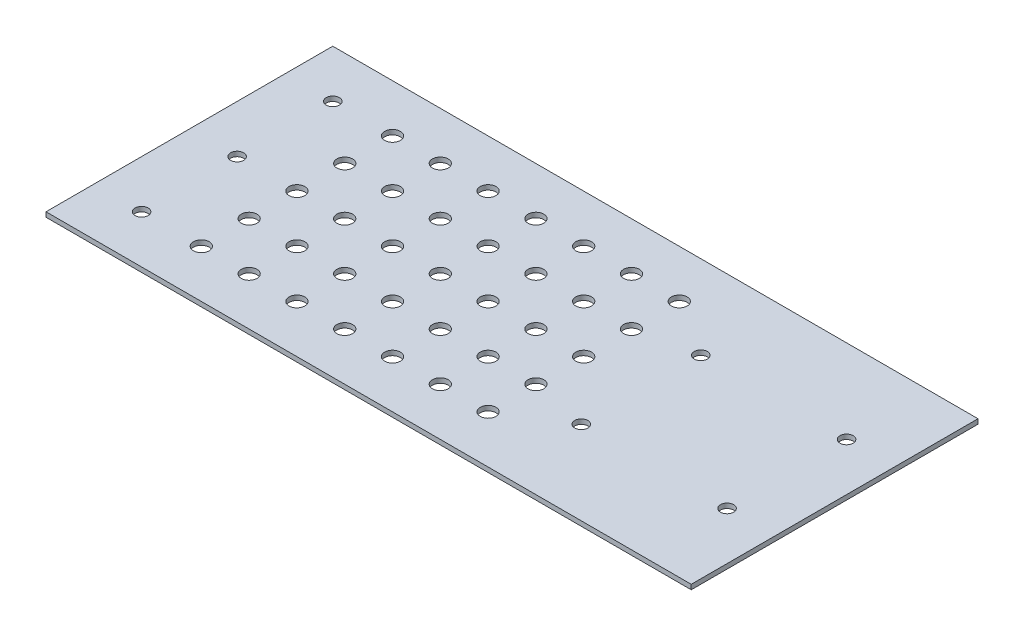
ISO-10303-21;
HEADER;
FILE_DESCRIPTION(('STEP AP214'),'2;1');
FILE_NAME('part.step','',(''),(''),'','','');
FILE_SCHEMA(('AUTOMOTIVE_DESIGN { 1 0 10303 214 1 1 1 1 }'));
ENDSEC;
DATA;
#1=APPLICATION_CONTEXT('core data for automotive mechanical design processes');
#2=APPLICATION_PROTOCOL_DEFINITION('international standard','automotive_design',2000,#1);
#3=PRODUCT_CONTEXT('',#1,'mechanical');
#4=PRODUCT('Part','Part','',(#3));
#5=PRODUCT_RELATED_PRODUCT_CATEGORY('part','',(#4));
#6=PRODUCT_DEFINITION_FORMATION('','',#4);
#7=PRODUCT_DEFINITION_CONTEXT('part definition',#1,'design');
#8=PRODUCT_DEFINITION('design','',#6,#7);
#9=PRODUCT_DEFINITION_SHAPE('','',#8);
#10=(LENGTH_UNIT() NAMED_UNIT(*) SI_UNIT(.MILLI.,.METRE.));
#11=(NAMED_UNIT(*) PLANE_ANGLE_UNIT() SI_UNIT($,.RADIAN.));
#12=(NAMED_UNIT(*) SI_UNIT($,.STERADIAN.) SOLID_ANGLE_UNIT());
#13=UNCERTAINTY_MEASURE_WITH_UNIT(LENGTH_MEASURE(1.E-05),#10,'distance_accuracy_value','');
#14=(GEOMETRIC_REPRESENTATION_CONTEXT(3) GLOBAL_UNCERTAINTY_ASSIGNED_CONTEXT((#13)) GLOBAL_UNIT_ASSIGNED_CONTEXT((#10,
#11,#12)) REPRESENTATION_CONTEXT('',''));
#15=CARTESIAN_POINT('',(0.,0.,0.));
#16=DIRECTION('',(0.,0.,1.));
#17=DIRECTION('',(1.,0.,0.));
#18=AXIS2_PLACEMENT_3D('',#15,#16,#17);
#19=CARTESIAN_POINT('',(135.,2.,60.));
#20=DIRECTION('',(-1.,0.,0.));
#21=DIRECTION('',(0.,0.,1.));
#22=AXIS2_PLACEMENT_3D('',#19,#20,#21);
#23=PLANE('',#22);
#24=DIRECTION('',(0.,0.,-1.));
#25=VECTOR('',#24,1.);
#26=CARTESIAN_POINT('',(135.,0.,60.));
#27=LINE('',#26,#25);
#28=CARTESIAN_POINT('',(135.,0.,60.));
#29=VERTEX_POINT('',#28);
#30=CARTESIAN_POINT('',(135.,0.,-60.));
#31=VERTEX_POINT('',#30);
#32=EDGE_CURVE('E105',#29,#31,#27,.T.);
#33=ORIENTED_EDGE('',*,*,#32,.T.);
#34=DIRECTION('',(0.,-1.,0.));
#35=VECTOR('',#34,1.);
#36=CARTESIAN_POINT('',(135.,2.,-60.));
#37=LINE('',#36,#35);
#38=CARTESIAN_POINT('',(135.,2.,-60.));
#39=VERTEX_POINT('',#38);
#40=EDGE_CURVE('E11',#39,#31,#37,.T.);
#41=ORIENTED_EDGE('',*,*,#40,.F.);
#42=DIRECTION('',(0.,0.,-1.));
#43=VECTOR('',#42,1.);
#44=CARTESIAN_POINT('',(135.,2.,60.));
#45=LINE('',#44,#43);
#46=CARTESIAN_POINT('',(135.,2.,60.));
#47=VERTEX_POINT('',#46);
#48=EDGE_CURVE('E92',#47,#39,#45,.T.);
#49=ORIENTED_EDGE('',*,*,#48,.F.);
#50=DIRECTION('',(0.,-1.,0.));
#51=VECTOR('',#50,1.);
#52=CARTESIAN_POINT('',(135.,2.,60.));
#53=LINE('',#52,#51);
#54=EDGE_CURVE('E101',#47,#29,#53,.T.);
#55=ORIENTED_EDGE('',*,*,#54,.T.);
#56=EDGE_LOOP('',(#33,#41,#49,#55));
#57=FACE_BOUND('',#56,.T.);
#58=ADVANCED_FACE('F39',(#57),#23,.F.);
#59=CARTESIAN_POINT('',(-135.,2.,-60.));
#60=DIRECTION('',(0.,0.,1.));
#61=DIRECTION('',(1.,0.,0.));
#62=AXIS2_PLACEMENT_3D('',#59,#60,#61);
#63=PLANE('',#62);
#64=DIRECTION('',(-1.,0.,0.));
#65=VECTOR('',#64,1.);
#66=CARTESIAN_POINT('',(-135.,0.,-60.));
#67=LINE('',#66,#65);
#68=CARTESIAN_POINT('',(-135.,0.,-60.));
#69=VERTEX_POINT('',#68);
#70=EDGE_CURVE('E96',#31,#69,#67,.T.);
#71=ORIENTED_EDGE('',*,*,#70,.T.);
#72=DIRECTION('',(0.,-1.,0.));
#73=VECTOR('',#72,1.);
#74=CARTESIAN_POINT('',(-135.,2.,-60.));
#75=LINE('',#74,#73);
#76=CARTESIAN_POINT('',(-135.,2.,-60.));
#77=VERTEX_POINT('',#76);
#78=EDGE_CURVE('E48',#77,#69,#75,.T.);
#79=ORIENTED_EDGE('',*,*,#78,.F.);
#80=DIRECTION('',(-1.,0.,0.));
#81=VECTOR('',#80,1.);
#82=CARTESIAN_POINT('',(-135.,2.,-60.));
#83=LINE('',#82,#81);
#84=EDGE_CURVE('E87',#39,#77,#83,.T.);
#85=ORIENTED_EDGE('',*,*,#84,.F.);
#86=ORIENTED_EDGE('',*,*,#40,.T.);
#87=EDGE_LOOP('',(#71,#79,#85,#86));
#88=FACE_BOUND('',#87,.T.);
#89=ADVANCED_FACE('F95',(#88),#63,.F.);
#90=CARTESIAN_POINT('',(-135.,2.,60.));
#91=DIRECTION('',(1.,0.,0.));
#92=DIRECTION('',(0.,0.,-1.));
#93=AXIS2_PLACEMENT_3D('',#90,#91,#92);
#94=PLANE('',#93);
#95=DIRECTION('',(0.,0.,1.));
#96=VECTOR('',#95,1.);
#97=CARTESIAN_POINT('',(-135.,0.,60.));
#98=LINE('',#97,#96);
#99=CARTESIAN_POINT('',(-135.,0.,60.));
#100=VERTEX_POINT('',#99);
#101=EDGE_CURVE('E74',#69,#100,#98,.T.);
#102=ORIENTED_EDGE('',*,*,#101,.T.);
#103=DIRECTION('',(0.,-1.,0.));
#104=VECTOR('',#103,1.);
#105=CARTESIAN_POINT('',(-135.,2.,60.));
#106=LINE('',#105,#104);
#107=CARTESIAN_POINT('',(-135.,2.,60.));
#108=VERTEX_POINT('',#107);
#109=EDGE_CURVE('E97',#108,#100,#106,.T.);
#110=ORIENTED_EDGE('',*,*,#109,.F.);
#111=DIRECTION('',(0.,0.,1.));
#112=VECTOR('',#111,1.);
#113=CARTESIAN_POINT('',(-135.,2.,60.));
#114=LINE('',#113,#112);
#115=EDGE_CURVE('E90',#77,#108,#114,.T.);
#116=ORIENTED_EDGE('',*,*,#115,.F.);
#117=ORIENTED_EDGE('',*,*,#78,.T.);
#118=EDGE_LOOP('',(#102,#110,#116,#117));
#119=FACE_BOUND('',#118,.T.);
#120=ADVANCED_FACE('F99',(#119),#94,.F.);
#121=CARTESIAN_POINT('',(-135.,2.,60.));
#122=DIRECTION('',(0.,0.,-1.));
#123=DIRECTION('',(-1.,0.,0.));
#124=AXIS2_PLACEMENT_3D('',#121,#122,#123);
#125=PLANE('',#124);
#126=DIRECTION('',(1.,0.,0.));
#127=VECTOR('',#126,1.);
#128=CARTESIAN_POINT('',(-135.,0.,60.));
#129=LINE('',#128,#127);
#130=EDGE_CURVE('E80',#100,#29,#129,.T.);
#131=ORIENTED_EDGE('',*,*,#130,.T.);
#132=ORIENTED_EDGE('',*,*,#54,.F.);
#133=DIRECTION('',(1.,0.,0.));
#134=VECTOR('',#133,1.);
#135=CARTESIAN_POINT('',(-135.,2.,60.));
#136=LINE('',#135,#134);
#137=EDGE_CURVE('E57',#108,#47,#136,.T.);
#138=ORIENTED_EDGE('',*,*,#137,.F.);
#139=ORIENTED_EDGE('',*,*,#109,.T.);
#140=EDGE_LOOP('',(#131,#132,#138,#139));
#141=FACE_BOUND('',#140,.T.);
#142=ADVANCED_FACE('F370',(#141),#125,.F.);
#143=CARTESIAN_POINT('',(0.,2.,0.));
#144=DIRECTION('',(0.,-1.,0.));
#145=DIRECTION('',(0.,0.,-1.));
#146=AXIS2_PLACEMENT_3D('',#143,#144,#145);
#147=PLANE('',#146);
#148=CARTESIAN_POINT('',(115.,2.,25.));
#149=DIRECTION('',(0.,1.,0.));
#150=DIRECTION('',(0.,0.,1.));
#151=AXIS2_PLACEMENT_3D('',#148,#149,#150);
#152=CIRCLE('',#151,2.75000000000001);
#153=CARTESIAN_POINT('',(115.,2.,27.75));
#154=VERTEX_POINT('',#153);
#155=EDGE_CURVE('E781',#154,#154,#152,.T.);
#156=ORIENTED_EDGE('',*,*,#155,.F.);
#157=EDGE_LOOP('',(#156));
#158=FACE_BOUND('',#157,.T.);
#159=CARTESIAN_POINT('',(54.0000000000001,2.,-25.));
#160=DIRECTION('',(0.,1.,0.));
#161=DIRECTION('',(0.,0.,1.));
#162=AXIS2_PLACEMENT_3D('',#159,#160,#161);
#163=CIRCLE('',#162,2.75000000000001);
#164=CARTESIAN_POINT('',(54.0000000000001,2.,-22.25));
#165=VERTEX_POINT('',#164);
#166=EDGE_CURVE('E782',#165,#165,#163,.T.);
#167=ORIENTED_EDGE('',*,*,#166,.F.);
#168=EDGE_LOOP('',(#167));
#169=FACE_BOUND('',#168,.T.);
#170=CARTESIAN_POINT('',(54.,2.,25.));
#171=DIRECTION('',(0.,1.,0.));
#172=DIRECTION('',(0.,0.,1.));
#173=AXIS2_PLACEMENT_3D('',#170,#171,#172);
#174=CIRCLE('',#173,2.75000000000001);
#175=CARTESIAN_POINT('',(54.,2.,27.75));
#176=VERTEX_POINT('',#175);
#177=EDGE_CURVE('E786',#176,#176,#174,.T.);
#178=ORIENTED_EDGE('',*,*,#177,.F.);
#179=EDGE_LOOP('',(#178));
#180=FACE_BOUND('',#179,.T.);
#181=CARTESIAN_POINT('',(115.,2.,-25.));
#182=DIRECTION('',(0.,1.,0.));
#183=DIRECTION('',(0.,0.,1.));
#184=AXIS2_PLACEMENT_3D('',#181,#182,#183);
#185=CIRCLE('',#184,2.75000000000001);
#186=CARTESIAN_POINT('',(115.,2.,-22.25));
#187=VERTEX_POINT('',#186);
#188=EDGE_CURVE('E225',#187,#187,#185,.T.);
#189=ORIENTED_EDGE('',*,*,#188,.F.);
#190=EDGE_LOOP('',(#189));
#191=FACE_BOUND('',#190,.T.);
#192=CARTESIAN_POINT('',(29.9999999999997,2.,-20.));
#193=DIRECTION('',(0.,1.,0.));
#194=DIRECTION('',(0.,0.,1.));
#195=AXIS2_PLACEMENT_3D('',#192,#193,#194);
#196=CIRCLE('',#195,3.29999999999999);
#197=CARTESIAN_POINT('',(29.9999999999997,2.,-16.7));
#198=VERTEX_POINT('',#197);
#199=EDGE_CURVE('E260',#198,#198,#196,.T.);
#200=ORIENTED_EDGE('',*,*,#199,.F.);
#201=EDGE_LOOP('',(#200));
#202=FACE_BOUND('',#201,.T.);
#203=CARTESIAN_POINT('',(9.99999999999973,2.,-20.));
#204=DIRECTION('',(0.,1.,0.));
#205=DIRECTION('',(0.,0.,1.));
#206=AXIS2_PLACEMENT_3D('',#203,#204,#205);
#207=CIRCLE('',#206,3.29999999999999);
#208=CARTESIAN_POINT('',(9.99999999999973,2.,-16.7));
#209=VERTEX_POINT('',#208);
#210=EDGE_CURVE('E276',#209,#209,#207,.T.);
#211=ORIENTED_EDGE('',*,*,#210,.F.);
#212=EDGE_LOOP('',(#211));
#213=FACE_BOUND('',#212,.T.);
#214=CARTESIAN_POINT('',(-10.0000000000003,2.,-20.));
#215=DIRECTION('',(0.,1.,0.));
#216=DIRECTION('',(0.,0.,1.));
#217=AXIS2_PLACEMENT_3D('',#214,#215,#216);
#218=CIRCLE('',#217,3.29999999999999);
#219=CARTESIAN_POINT('',(-10.0000000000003,2.,-16.7));
#220=VERTEX_POINT('',#219);
#221=EDGE_CURVE('E273',#220,#220,#218,.T.);
#222=ORIENTED_EDGE('',*,*,#221,.F.);
#223=EDGE_LOOP('',(#222));
#224=FACE_BOUND('',#223,.T.);
#225=CARTESIAN_POINT('',(-30.0000000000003,2.,-20.));
#226=DIRECTION('',(0.,1.,0.));
#227=DIRECTION('',(0.,0.,1.));
#228=AXIS2_PLACEMENT_3D('',#225,#226,#227);
#229=CIRCLE('',#228,3.29999999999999);
#230=CARTESIAN_POINT('',(-30.0000000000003,2.,-16.7));
#231=VERTEX_POINT('',#230);
#232=EDGE_CURVE('E269',#231,#231,#229,.T.);
#233=ORIENTED_EDGE('',*,*,#232,.F.);
#234=EDGE_LOOP('',(#233));
#235=FACE_BOUND('',#234,.T.);
#236=CARTESIAN_POINT('',(-50.0000000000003,2.,-20.));
#237=DIRECTION('',(0.,1.,0.));
#238=DIRECTION('',(0.,0.,1.));
#239=AXIS2_PLACEMENT_3D('',#236,#237,#238);
#240=CIRCLE('',#239,3.29999999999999);
#241=CARTESIAN_POINT('',(-50.0000000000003,2.,-16.7));
#242=VERTEX_POINT('',#241);
#243=EDGE_CURVE('E272',#242,#242,#240,.T.);
#244=ORIENTED_EDGE('',*,*,#243,.F.);
#245=EDGE_LOOP('',(#244));
#246=FACE_BOUND('',#245,.T.);
#247=CARTESIAN_POINT('',(-70.0000000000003,2.,-20.));
#248=DIRECTION('',(0.,1.,0.));
#249=DIRECTION('',(0.,0.,1.));
#250=AXIS2_PLACEMENT_3D('',#247,#248,#249);
#251=CIRCLE('',#250,3.29999999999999);
#252=CARTESIAN_POINT('',(-70.0000000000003,2.,-16.7));
#253=VERTEX_POINT('',#252);
#254=EDGE_CURVE('E288',#253,#253,#251,.T.);
#255=ORIENTED_EDGE('',*,*,#254,.F.);
#256=EDGE_LOOP('',(#255));
#257=FACE_BOUND('',#256,.T.);
#258=CARTESIAN_POINT('',(29.9999999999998,2.,0.));
#259=DIRECTION('',(0.,1.,0.));
#260=DIRECTION('',(0.,0.,1.));
#261=AXIS2_PLACEMENT_3D('',#258,#259,#260);
#262=CIRCLE('',#261,3.29999999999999);
#263=CARTESIAN_POINT('',(29.9999999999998,2.,3.3));
#264=VERTEX_POINT('',#263);
#265=EDGE_CURVE('E285',#264,#264,#262,.T.);
#266=ORIENTED_EDGE('',*,*,#265,.F.);
#267=EDGE_LOOP('',(#266));
#268=FACE_BOUND('',#267,.T.);
#269=CARTESIAN_POINT('',(9.9999999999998,2.,0.));
#270=DIRECTION('',(0.,1.,0.));
#271=DIRECTION('',(0.,0.,1.));
#272=AXIS2_PLACEMENT_3D('',#269,#270,#271);
#273=CIRCLE('',#272,3.29999999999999);
#274=CARTESIAN_POINT('',(9.9999999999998,2.,3.3));
#275=VERTEX_POINT('',#274);
#276=EDGE_CURVE('E281',#275,#275,#273,.T.);
#277=ORIENTED_EDGE('',*,*,#276,.F.);
#278=EDGE_LOOP('',(#277));
#279=FACE_BOUND('',#278,.T.);
#280=CARTESIAN_POINT('',(-90.0000000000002,2.,0.));
#281=DIRECTION('',(0.,1.,0.));
#282=DIRECTION('',(0.,0.,1.));
#283=AXIS2_PLACEMENT_3D('',#280,#281,#282);
#284=CIRCLE('',#283,3.29999999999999);
#285=CARTESIAN_POINT('',(-90.0000000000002,2.,3.3));
#286=VERTEX_POINT('',#285);
#287=EDGE_CURVE('E241',#286,#286,#284,.T.);
#288=ORIENTED_EDGE('',*,*,#287,.F.);
#289=EDGE_LOOP('',(#288));
#290=FACE_BOUND('',#289,.T.);
#291=CARTESIAN_POINT('',(-90.0000000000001,2.,20.));
#292=DIRECTION('',(0.,1.,0.));
#293=DIRECTION('',(0.,0.,1.));
#294=AXIS2_PLACEMENT_3D('',#291,#292,#293);
#295=CIRCLE('',#294,3.3);
#296=CARTESIAN_POINT('',(-90.0000000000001,2.,23.3));
#297=VERTEX_POINT('',#296);
#298=EDGE_CURVE('E252',#297,#297,#295,.T.);
#299=ORIENTED_EDGE('',*,*,#298,.F.);
#300=EDGE_LOOP('',(#299));
#301=FACE_BOUND('',#300,.T.);
#302=CARTESIAN_POINT('',(29.9999999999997,2.,-40.));
#303=DIRECTION('',(0.,1.,0.));
#304=DIRECTION('',(0.,0.,1.));
#305=AXIS2_PLACEMENT_3D('',#302,#303,#304);
#306=CIRCLE('',#305,3.29999999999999);
#307=CARTESIAN_POINT('',(29.9999999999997,2.,-36.7));
#308=VERTEX_POINT('',#307);
#309=EDGE_CURVE('E249',#308,#308,#306,.T.);
#310=ORIENTED_EDGE('',*,*,#309,.F.);
#311=EDGE_LOOP('',(#310));
#312=FACE_BOUND('',#311,.T.);
#313=CARTESIAN_POINT('',(9.99999999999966,2.,-40.));
#314=DIRECTION('',(0.,1.,0.));
#315=DIRECTION('',(0.,0.,1.));
#316=AXIS2_PLACEMENT_3D('',#313,#314,#315);
#317=CIRCLE('',#316,3.29999999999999);
#318=CARTESIAN_POINT('',(9.99999999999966,2.,-36.7));
#319=VERTEX_POINT('',#318);
#320=EDGE_CURVE('E245',#319,#319,#317,.T.);
#321=ORIENTED_EDGE('',*,*,#320,.F.);
#322=EDGE_LOOP('',(#321));
#323=FACE_BOUND('',#322,.T.);
#324=CARTESIAN_POINT('',(-10.0000000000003,2.,-40.));
#325=DIRECTION('',(0.,1.,0.));
#326=DIRECTION('',(0.,0.,1.));
#327=AXIS2_PLACEMENT_3D('',#324,#325,#326);
#328=CIRCLE('',#327,3.29999999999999);
#329=CARTESIAN_POINT('',(-10.0000000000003,2.,-36.7));
#330=VERTEX_POINT('',#329);
#331=EDGE_CURVE('E248',#330,#330,#328,.T.);
#332=ORIENTED_EDGE('',*,*,#331,.F.);
#333=EDGE_LOOP('',(#332));
#334=FACE_BOUND('',#333,.T.);
#335=CARTESIAN_POINT('',(-30.0000000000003,2.,-40.));
#336=DIRECTION('',(0.,1.,0.));
#337=DIRECTION('',(0.,0.,1.));
#338=AXIS2_PLACEMENT_3D('',#335,#336,#337);
#339=CIRCLE('',#338,3.29999999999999);
#340=CARTESIAN_POINT('',(-30.0000000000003,2.,-36.7));
#341=VERTEX_POINT('',#340);
#342=EDGE_CURVE('E264',#341,#341,#339,.T.);
#343=ORIENTED_EDGE('',*,*,#342,.F.);
#344=EDGE_LOOP('',(#343));
#345=FACE_BOUND('',#344,.T.);
#346=CARTESIAN_POINT('',(-50.0000000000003,2.,-40.));
#347=DIRECTION('',(0.,1.,0.));
#348=DIRECTION('',(0.,0.,1.));
#349=AXIS2_PLACEMENT_3D('',#346,#347,#348);
#350=CIRCLE('',#349,3.29999999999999);
#351=CARTESIAN_POINT('',(-50.0000000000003,2.,-36.7));
#352=VERTEX_POINT('',#351);
#353=EDGE_CURVE('E261',#352,#352,#350,.T.);
#354=ORIENTED_EDGE('',*,*,#353,.F.);
#355=EDGE_LOOP('',(#354));
#356=FACE_BOUND('',#355,.T.);
#357=CARTESIAN_POINT('',(-70.0000000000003,2.,-40.));
#358=DIRECTION('',(0.,1.,0.));
#359=DIRECTION('',(0.,0.,1.));
#360=AXIS2_PLACEMENT_3D('',#357,#358,#359);
#361=CIRCLE('',#360,3.3);
#362=CARTESIAN_POINT('',(-70.0000000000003,2.,-36.7));
#363=VERTEX_POINT('',#362);
#364=EDGE_CURVE('E257',#363,#363,#361,.T.);
#365=ORIENTED_EDGE('',*,*,#364,.F.);
#366=EDGE_LOOP('',(#365));
#367=FACE_BOUND('',#366,.T.);
#368=CARTESIAN_POINT('',(-50.0000000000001,2.,20.));
#369=DIRECTION('',(0.,1.,0.));
#370=DIRECTION('',(0.,0.,1.));
#371=AXIS2_PLACEMENT_3D('',#368,#369,#370);
#372=CIRCLE('',#371,3.29999999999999);
#373=CARTESIAN_POINT('',(-50.0000000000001,2.,23.3));
#374=VERTEX_POINT('',#373);
#375=EDGE_CURVE('E296',#374,#374,#372,.T.);
#376=ORIENTED_EDGE('',*,*,#375,.F.);
#377=EDGE_LOOP('',(#376));
#378=FACE_BOUND('',#377,.T.);
#379=CARTESIAN_POINT('',(-70.0000000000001,2.,20.));
#380=DIRECTION('',(0.,1.,0.));
#381=DIRECTION('',(0.,0.,1.));
#382=AXIS2_PLACEMENT_3D('',#379,#380,#381);
#383=CIRCLE('',#382,3.29999999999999);
#384=CARTESIAN_POINT('',(-70.0000000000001,2.,23.3));
#385=VERTEX_POINT('',#384);
#386=EDGE_CURVE('E324',#385,#385,#383,.T.);
#387=ORIENTED_EDGE('',*,*,#386,.F.);
#388=EDGE_LOOP('',(#387));
#389=FACE_BOUND('',#388,.T.);
#390=CARTESIAN_POINT('',(29.9999999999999,2.,40.));
#391=DIRECTION('',(0.,1.,0.));
#392=DIRECTION('',(0.,0.,1.));
#393=AXIS2_PLACEMENT_3D('',#390,#391,#392);
#394=CIRCLE('',#393,3.29999999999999);
#395=CARTESIAN_POINT('',(29.9999999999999,2.,43.3));
#396=VERTEX_POINT('',#395);
#397=EDGE_CURVE('E321',#396,#396,#394,.T.);
#398=ORIENTED_EDGE('',*,*,#397,.F.);
#399=EDGE_LOOP('',(#398));
#400=FACE_BOUND('',#399,.T.);
#401=CARTESIAN_POINT('',(9.99999999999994,2.,40.));
#402=DIRECTION('',(0.,1.,0.));
#403=DIRECTION('',(0.,0.,1.));
#404=AXIS2_PLACEMENT_3D('',#401,#402,#403);
#405=CIRCLE('',#404,3.29999999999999);
#406=CARTESIAN_POINT('',(9.99999999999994,2.,43.3));
#407=VERTEX_POINT('',#406);
#408=EDGE_CURVE('E317',#407,#407,#405,.T.);
#409=ORIENTED_EDGE('',*,*,#408,.F.);
#410=EDGE_LOOP('',(#409));
#411=FACE_BOUND('',#410,.T.);
#412=CARTESIAN_POINT('',(-10.0000000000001,2.,40.));
#413=DIRECTION('',(0.,1.,0.));
#414=DIRECTION('',(0.,0.,1.));
#415=AXIS2_PLACEMENT_3D('',#412,#413,#414);
#416=CIRCLE('',#415,3.29999999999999);
#417=CARTESIAN_POINT('',(-10.0000000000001,2.,43.3));
#418=VERTEX_POINT('',#417);
#419=EDGE_CURVE('E320',#418,#418,#416,.T.);
#420=ORIENTED_EDGE('',*,*,#419,.F.);
#421=EDGE_LOOP('',(#420));
#422=FACE_BOUND('',#421,.T.);
#423=CARTESIAN_POINT('',(-30.0000000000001,2.,40.));
#424=DIRECTION('',(0.,1.,0.));
#425=DIRECTION('',(0.,0.,1.));
#426=AXIS2_PLACEMENT_3D('',#423,#424,#425);
#427=CIRCLE('',#426,3.29999999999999);
#428=CARTESIAN_POINT('',(-30.0000000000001,2.,43.3));
#429=VERTEX_POINT('',#428);
#430=EDGE_CURVE('E335',#429,#429,#427,.T.);
#431=ORIENTED_EDGE('',*,*,#430,.F.);
#432=EDGE_LOOP('',(#431));
#433=FACE_BOUND('',#432,.T.);
#434=CARTESIAN_POINT('',(-50.0000000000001,2.,40.));
#435=DIRECTION('',(0.,1.,0.));
#436=DIRECTION('',(0.,0.,1.));
#437=AXIS2_PLACEMENT_3D('',#434,#435,#436);
#438=CIRCLE('',#437,3.29999999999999);
#439=CARTESIAN_POINT('',(-50.0000000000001,2.,43.3));
#440=VERTEX_POINT('',#439);
#441=EDGE_CURVE('E332',#440,#440,#438,.T.);
#442=ORIENTED_EDGE('',*,*,#441,.F.);
#443=EDGE_LOOP('',(#442));
#444=FACE_BOUND('',#443,.T.);
#445=CARTESIAN_POINT('',(-70.0000000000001,2.,40.));
#446=DIRECTION('',(0.,1.,0.));
#447=DIRECTION('',(0.,0.,1.));
#448=AXIS2_PLACEMENT_3D('',#445,#446,#447);
#449=CIRCLE('',#448,3.3);
#450=CARTESIAN_POINT('',(-70.0000000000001,2.,43.3));
#451=VERTEX_POINT('',#450);
#452=EDGE_CURVE('E329',#451,#451,#449,.T.);
#453=ORIENTED_EDGE('',*,*,#452,.F.);
#454=EDGE_LOOP('',(#453));
#455=FACE_BOUND('',#454,.T.);
#456=CARTESIAN_POINT('',(-30.0000000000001,2.,20.));
#457=DIRECTION('',(0.,1.,0.));
#458=DIRECTION('',(0.,0.,1.));
#459=AXIS2_PLACEMENT_3D('',#456,#457,#458);
#460=CIRCLE('',#459,3.29999999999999);
#461=CARTESIAN_POINT('',(-30.0000000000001,2.,23.3));
#462=VERTEX_POINT('',#461);
#463=EDGE_CURVE('E293',#462,#462,#460,.T.);
#464=ORIENTED_EDGE('',*,*,#463,.F.);
#465=EDGE_LOOP('',(#464));
#466=FACE_BOUND('',#465,.T.);
#467=CARTESIAN_POINT('',(-10.0000000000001,2.,20.));
#468=DIRECTION('',(0.,1.,0.));
#469=DIRECTION('',(0.,0.,1.));
#470=AXIS2_PLACEMENT_3D('',#467,#468,#469);
#471=CIRCLE('',#470,3.29999999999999);
#472=CARTESIAN_POINT('',(-10.0000000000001,2.,23.3));
#473=VERTEX_POINT('',#472);
#474=EDGE_CURVE('E297',#473,#473,#471,.T.);
#475=ORIENTED_EDGE('',*,*,#474,.F.);
#476=EDGE_LOOP('',(#475));
#477=FACE_BOUND('',#476,.T.);
#478=CARTESIAN_POINT('',(9.99999999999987,2.,20.));
#479=DIRECTION('',(0.,1.,0.));
#480=DIRECTION('',(0.,0.,1.));
#481=AXIS2_PLACEMENT_3D('',#478,#479,#480);
#482=CIRCLE('',#481,3.29999999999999);
#483=CARTESIAN_POINT('',(9.99999999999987,2.,23.3));
#484=VERTEX_POINT('',#483);
#485=EDGE_CURVE('E300',#484,#484,#482,.T.);
#486=ORIENTED_EDGE('',*,*,#485,.F.);
#487=EDGE_LOOP('',(#486));
#488=FACE_BOUND('',#487,.T.);
#489=CARTESIAN_POINT('',(29.9999999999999,2.,20.));
#490=DIRECTION('',(0.,1.,0.));
#491=DIRECTION('',(0.,0.,1.));
#492=AXIS2_PLACEMENT_3D('',#489,#490,#491);
#493=CIRCLE('',#492,3.29999999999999);
#494=CARTESIAN_POINT('',(29.9999999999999,2.,23.3));
#495=VERTEX_POINT('',#494);
#496=EDGE_CURVE('E303',#495,#495,#493,.T.);
#497=ORIENTED_EDGE('',*,*,#496,.F.);
#498=EDGE_LOOP('',(#497));
#499=FACE_BOUND('',#498,.T.);
#500=CARTESIAN_POINT('',(-70.0000000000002,2.,0.));
#501=DIRECTION('',(0.,1.,0.));
#502=DIRECTION('',(0.,0.,1.));
#503=AXIS2_PLACEMENT_3D('',#500,#501,#502);
#504=CIRCLE('',#503,3.3);
#505=CARTESIAN_POINT('',(-70.0000000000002,2.,3.30000000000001));
#506=VERTEX_POINT('',#505);
#507=EDGE_CURVE('E306',#506,#506,#504,.T.);
#508=ORIENTED_EDGE('',*,*,#507,.F.);
#509=EDGE_LOOP('',(#508));
#510=FACE_BOUND('',#509,.T.);
#511=CARTESIAN_POINT('',(-50.0000000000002,2.,0.));
#512=DIRECTION('',(0.,1.,0.));
#513=DIRECTION('',(0.,0.,1.));
#514=AXIS2_PLACEMENT_3D('',#511,#512,#513);
#515=CIRCLE('',#514,3.29999999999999);
#516=CARTESIAN_POINT('',(-50.0000000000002,2.,3.3));
#517=VERTEX_POINT('',#516);
#518=EDGE_CURVE('E309',#517,#517,#515,.T.);
#519=ORIENTED_EDGE('',*,*,#518,.F.);
#520=EDGE_LOOP('',(#519));
#521=FACE_BOUND('',#520,.T.);
#522=CARTESIAN_POINT('',(-30.0000000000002,2.,0.));
#523=DIRECTION('',(0.,1.,0.));
#524=DIRECTION('',(0.,0.,1.));
#525=AXIS2_PLACEMENT_3D('',#522,#523,#524);
#526=CIRCLE('',#525,3.29999999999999);
#527=CARTESIAN_POINT('',(-30.0000000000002,2.,3.3));
#528=VERTEX_POINT('',#527);
#529=EDGE_CURVE('E312',#528,#528,#526,.T.);
#530=ORIENTED_EDGE('',*,*,#529,.F.);
#531=EDGE_LOOP('',(#530));
#532=FACE_BOUND('',#531,.T.);
#533=CARTESIAN_POINT('',(-10.0000000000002,2.,0.));
#534=DIRECTION('',(0.,1.,0.));
#535=DIRECTION('',(0.,0.,1.));
#536=AXIS2_PLACEMENT_3D('',#533,#534,#535);
#537=CIRCLE('',#536,3.29999999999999);
#538=CARTESIAN_POINT('',(-10.0000000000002,2.,3.3));
#539=VERTEX_POINT('',#538);
#540=EDGE_CURVE('E284',#539,#539,#537,.T.);
#541=ORIENTED_EDGE('',*,*,#540,.F.);
#542=EDGE_LOOP('',(#541));
#543=FACE_BOUND('',#542,.T.);
#544=CARTESIAN_POINT('',(-90.0000000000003,2.,-20.));
#545=DIRECTION('',(0.,1.,0.));
#546=DIRECTION('',(0.,0.,1.));
#547=AXIS2_PLACEMENT_3D('',#544,#545,#546);
#548=CIRCLE('',#547,3.3);
#549=CARTESIAN_POINT('',(-90.0000000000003,2.,-16.7));
#550=VERTEX_POINT('',#549);
#551=EDGE_CURVE('E236',#550,#550,#548,.T.);
#552=ORIENTED_EDGE('',*,*,#551,.F.);
#553=EDGE_LOOP('',(#552));
#554=FACE_BOUND('',#553,.T.);
#555=CARTESIAN_POINT('',(-90.0000000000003,2.,-40.));
#556=DIRECTION('',(0.,1.,0.));
#557=DIRECTION('',(0.,0.,1.));
#558=AXIS2_PLACEMENT_3D('',#555,#556,#557);
#559=CIRCLE('',#558,3.29999999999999);
#560=CARTESIAN_POINT('',(-90.0000000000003,2.,-36.7));
#561=VERTEX_POINT('',#560);
#562=EDGE_CURVE('E232',#561,#561,#559,.T.);
#563=ORIENTED_EDGE('',*,*,#562,.F.);
#564=EDGE_LOOP('',(#563));
#565=FACE_BOUND('',#564,.T.);
#566=CARTESIAN_POINT('',(-90.0000000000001,2.,40.));
#567=DIRECTION('',(0.,1.,0.));
#568=DIRECTION('',(0.,0.,1.));
#569=AXIS2_PLACEMENT_3D('',#566,#567,#568);
#570=CIRCLE('',#569,3.29999999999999);
#571=CARTESIAN_POINT('',(-90.0000000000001,2.,43.3));
#572=VERTEX_POINT('',#571);
#573=EDGE_CURVE('E118',#572,#572,#570,.T.);
#574=ORIENTED_EDGE('',*,*,#573,.F.);
#575=EDGE_LOOP('',(#574));
#576=FACE_BOUND('',#575,.T.);
#577=CARTESIAN_POINT('',(-115.,2.,40.));
#578=DIRECTION('',(0.,1.,0.));
#579=DIRECTION('',(0.,0.,1.));
#580=AXIS2_PLACEMENT_3D('',#577,#578,#579);
#581=CIRCLE('',#580,2.75000000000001);
#582=CARTESIAN_POINT('',(-115.,2.,42.75));
#583=VERTEX_POINT('',#582);
#584=EDGE_CURVE('E344',#583,#583,#581,.T.);
#585=ORIENTED_EDGE('',*,*,#584,.F.);
#586=EDGE_LOOP('',(#585));
#587=FACE_BOUND('',#586,.T.);
#588=CARTESIAN_POINT('',(-115.,2.,0.));
#589=DIRECTION('',(0.,1.,0.));
#590=DIRECTION('',(0.,0.,1.));
#591=AXIS2_PLACEMENT_3D('',#588,#589,#590);
#592=CIRCLE('',#591,2.75000000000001);
#593=CARTESIAN_POINT('',(-115.,2.,2.75000000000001));
#594=VERTEX_POINT('',#593);
#595=EDGE_CURVE('E347',#594,#594,#592,.T.);
#596=ORIENTED_EDGE('',*,*,#595,.F.);
#597=EDGE_LOOP('',(#596));
#598=FACE_BOUND('',#597,.T.);
#599=CARTESIAN_POINT('',(-115.,2.,-40.));
#600=DIRECTION('',(0.,1.,0.));
#601=DIRECTION('',(0.,0.,1.));
#602=AXIS2_PLACEMENT_3D('',#599,#600,#601);
#603=CIRCLE('',#602,2.75000000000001);
#604=CARTESIAN_POINT('',(-115.,2.,-37.25));
#605=VERTEX_POINT('',#604);
#606=EDGE_CURVE('E353',#605,#605,#603,.T.);
#607=ORIENTED_EDGE('',*,*,#606,.F.);
#608=EDGE_LOOP('',(#607));
#609=FACE_BOUND('',#608,.T.);
#610=ORIENTED_EDGE('',*,*,#48,.T.);
#611=ORIENTED_EDGE('',*,*,#84,.T.);
#612=ORIENTED_EDGE('',*,*,#115,.T.);
#613=ORIENTED_EDGE('',*,*,#137,.T.);
#614=EDGE_LOOP('',(#610,#611,#612,#613));
#615=FACE_BOUND('',#614,.T.);
#616=ADVANCED_FACE('F88',(#158,#169,#180,#191,#202,#213,#224,#235,#246,#257,#268,#279,#290,#301,
#312,#323,#334,#345,#356,#367,#378,#389,#400,#411,#422,#433,#444,#455,#466,#477,#488,#499,#510,
#521,#532,#543,#554,#565,#576,#587,#598,#609,#615),#147,.F.);
#617=CARTESIAN_POINT('',(0.,0.,0.));
#618=DIRECTION('',(0.,-1.,0.));
#619=DIRECTION('',(0.,0.,-1.));
#620=AXIS2_PLACEMENT_3D('',#617,#618,#619);
#621=PLANE('',#620);
#622=CARTESIAN_POINT('',(115.,0.,25.));
#623=DIRECTION('',(0.,-1.,0.));
#624=DIRECTION('',(0.,0.,-1.));
#625=AXIS2_PLACEMENT_3D('',#622,#623,#624);
#626=CIRCLE('',#625,2.75000000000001);
#627=CARTESIAN_POINT('',(115.,0.,22.25));
#628=VERTEX_POINT('',#627);
#629=EDGE_CURVE('E42',#628,#628,#626,.T.);
#630=ORIENTED_EDGE('',*,*,#629,.F.);
#631=EDGE_LOOP('',(#630));
#632=FACE_BOUND('',#631,.T.);
#633=CARTESIAN_POINT('',(54.0000000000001,0.,-25.));
#634=DIRECTION('',(0.,-1.,0.));
#635=DIRECTION('',(0.,0.,-1.));
#636=AXIS2_PLACEMENT_3D('',#633,#634,#635);
#637=CIRCLE('',#636,2.75000000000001);
#638=CARTESIAN_POINT('',(54.0000000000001,0.,-27.7500000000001));
#639=VERTEX_POINT('',#638);
#640=EDGE_CURVE('E227',#639,#639,#637,.T.);
#641=ORIENTED_EDGE('',*,*,#640,.F.);
#642=EDGE_LOOP('',(#641));
#643=FACE_BOUND('',#642,.T.);
#644=CARTESIAN_POINT('',(54.,0.,25.));
#645=DIRECTION('',(0.,-1.,0.));
#646=DIRECTION('',(0.,0.,-1.));
#647=AXIS2_PLACEMENT_3D('',#644,#645,#646);
#648=CIRCLE('',#647,2.75000000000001);
#649=CARTESIAN_POINT('',(54.,0.,22.25));
#650=VERTEX_POINT('',#649);
#651=EDGE_CURVE('E224',#650,#650,#648,.T.);
#652=ORIENTED_EDGE('',*,*,#651,.F.);
#653=EDGE_LOOP('',(#652));
#654=FACE_BOUND('',#653,.T.);
#655=CARTESIAN_POINT('',(115.,0.,-25.));
#656=DIRECTION('',(0.,-1.,0.));
#657=DIRECTION('',(0.,0.,-1.));
#658=AXIS2_PLACEMENT_3D('',#655,#656,#657);
#659=CIRCLE('',#658,2.75000000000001);
#660=CARTESIAN_POINT('',(115.,0.,-27.7500000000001));
#661=VERTEX_POINT('',#660);
#662=EDGE_CURVE('E221',#661,#661,#659,.T.);
#663=ORIENTED_EDGE('',*,*,#662,.F.);
#664=EDGE_LOOP('',(#663));
#665=FACE_BOUND('',#664,.T.);
#666=CARTESIAN_POINT('',(29.9999999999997,0.,-20.));
#667=DIRECTION('',(0.,-1.,0.));
#668=DIRECTION('',(0.,0.,-1.));
#669=AXIS2_PLACEMENT_3D('',#666,#667,#668);
#670=CIRCLE('',#669,3.29999999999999);
#671=CARTESIAN_POINT('',(29.9999999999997,0.,-23.3));
#672=VERTEX_POINT('',#671);
#673=EDGE_CURVE('E217',#672,#672,#670,.T.);
#674=ORIENTED_EDGE('',*,*,#673,.F.);
#675=EDGE_LOOP('',(#674));
#676=FACE_BOUND('',#675,.T.);
#677=CARTESIAN_POINT('',(9.99999999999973,0.,-20.));
#678=DIRECTION('',(0.,-1.,0.));
#679=DIRECTION('',(0.,0.,-1.));
#680=AXIS2_PLACEMENT_3D('',#677,#678,#679);
#681=CIRCLE('',#680,3.29999999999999);
#682=CARTESIAN_POINT('',(9.99999999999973,0.,-23.3));
#683=VERTEX_POINT('',#682);
#684=EDGE_CURVE('E214',#683,#683,#681,.T.);
#685=ORIENTED_EDGE('',*,*,#684,.F.);
#686=EDGE_LOOP('',(#685));
#687=FACE_BOUND('',#686,.T.);
#688=CARTESIAN_POINT('',(-10.0000000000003,0.,-20.));
#689=DIRECTION('',(0.,-1.,0.));
#690=DIRECTION('',(0.,0.,-1.));
#691=AXIS2_PLACEMENT_3D('',#688,#689,#690);
#692=CIRCLE('',#691,3.29999999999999);
#693=CARTESIAN_POINT('',(-10.0000000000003,0.,-23.3));
#694=VERTEX_POINT('',#693);
#695=EDGE_CURVE('E211',#694,#694,#692,.T.);
#696=ORIENTED_EDGE('',*,*,#695,.F.);
#697=EDGE_LOOP('',(#696));
#698=FACE_BOUND('',#697,.T.);
#699=CARTESIAN_POINT('',(-30.0000000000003,0.,-20.));
#700=DIRECTION('',(0.,-1.,0.));
#701=DIRECTION('',(0.,0.,-1.));
#702=AXIS2_PLACEMENT_3D('',#699,#700,#701);
#703=CIRCLE('',#702,3.29999999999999);
#704=CARTESIAN_POINT('',(-30.0000000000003,0.,-23.3));
#705=VERTEX_POINT('',#704);
#706=EDGE_CURVE('E208',#705,#705,#703,.T.);
#707=ORIENTED_EDGE('',*,*,#706,.F.);
#708=EDGE_LOOP('',(#707));
#709=FACE_BOUND('',#708,.T.);
#710=CARTESIAN_POINT('',(-50.0000000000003,0.,-20.));
#711=DIRECTION('',(0.,-1.,0.));
#712=DIRECTION('',(0.,0.,-1.));
#713=AXIS2_PLACEMENT_3D('',#710,#711,#712);
#714=CIRCLE('',#713,3.29999999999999);
#715=CARTESIAN_POINT('',(-50.0000000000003,0.,-23.3));
#716=VERTEX_POINT('',#715);
#717=EDGE_CURVE('E205',#716,#716,#714,.T.);
#718=ORIENTED_EDGE('',*,*,#717,.F.);
#719=EDGE_LOOP('',(#718));
#720=FACE_BOUND('',#719,.T.);
#721=CARTESIAN_POINT('',(-70.0000000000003,0.,-20.));
#722=DIRECTION('',(0.,-1.,0.));
#723=DIRECTION('',(0.,0.,-1.));
#724=AXIS2_PLACEMENT_3D('',#721,#722,#723);
#725=CIRCLE('',#724,3.29999999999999);
#726=CARTESIAN_POINT('',(-70.0000000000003,0.,-23.3));
#727=VERTEX_POINT('',#726);
#728=EDGE_CURVE('E202',#727,#727,#725,.T.);
#729=ORIENTED_EDGE('',*,*,#728,.F.);
#730=EDGE_LOOP('',(#729));
#731=FACE_BOUND('',#730,.T.);
#732=CARTESIAN_POINT('',(29.9999999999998,0.,0.));
#733=DIRECTION('',(0.,-1.,0.));
#734=DIRECTION('',(0.,0.,-1.));
#735=AXIS2_PLACEMENT_3D('',#732,#733,#734);
#736=CIRCLE('',#735,3.29999999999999);
#737=CARTESIAN_POINT('',(29.9999999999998,0.,-3.29999999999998));
#738=VERTEX_POINT('',#737);
#739=EDGE_CURVE('E199',#738,#738,#736,.T.);
#740=ORIENTED_EDGE('',*,*,#739,.F.);
#741=EDGE_LOOP('',(#740));
#742=FACE_BOUND('',#741,.T.);
#743=CARTESIAN_POINT('',(9.9999999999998,0.,0.));
#744=DIRECTION('',(0.,-1.,0.));
#745=DIRECTION('',(0.,0.,-1.));
#746=AXIS2_PLACEMENT_3D('',#743,#744,#745);
#747=CIRCLE('',#746,3.29999999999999);
#748=CARTESIAN_POINT('',(9.9999999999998,0.,-3.29999999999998));
#749=VERTEX_POINT('',#748);
#750=EDGE_CURVE('E196',#749,#749,#747,.T.);
#751=ORIENTED_EDGE('',*,*,#750,.F.);
#752=EDGE_LOOP('',(#751));
#753=FACE_BOUND('',#752,.T.);
#754=CARTESIAN_POINT('',(-90.0000000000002,0.,0.));
#755=DIRECTION('',(0.,-1.,0.));
#756=DIRECTION('',(0.,0.,-1.));
#757=AXIS2_PLACEMENT_3D('',#754,#755,#756);
#758=CIRCLE('',#757,3.29999999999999);
#759=CARTESIAN_POINT('',(-90.0000000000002,0.,-3.29999999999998));
#760=VERTEX_POINT('',#759);
#761=EDGE_CURVE('E193',#760,#760,#758,.T.);
#762=ORIENTED_EDGE('',*,*,#761,.F.);
#763=EDGE_LOOP('',(#762));
#764=FACE_BOUND('',#763,.T.);
#765=CARTESIAN_POINT('',(-90.0000000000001,0.,20.));
#766=DIRECTION('',(0.,-1.,0.));
#767=DIRECTION('',(0.,0.,-1.));
#768=AXIS2_PLACEMENT_3D('',#765,#766,#767);
#769=CIRCLE('',#768,3.3);
#770=CARTESIAN_POINT('',(-90.0000000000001,0.,16.7));
#771=VERTEX_POINT('',#770);
#772=EDGE_CURVE('E190',#771,#771,#769,.T.);
#773=ORIENTED_EDGE('',*,*,#772,.F.);
#774=EDGE_LOOP('',(#773));
#775=FACE_BOUND('',#774,.T.);
#776=CARTESIAN_POINT('',(29.9999999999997,0.,-40.));
#777=DIRECTION('',(0.,-1.,0.));
#778=DIRECTION('',(0.,0.,-1.));
#779=AXIS2_PLACEMENT_3D('',#776,#777,#778);
#780=CIRCLE('',#779,3.29999999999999);
#781=CARTESIAN_POINT('',(29.9999999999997,0.,-43.3));
#782=VERTEX_POINT('',#781);
#783=EDGE_CURVE('E187',#782,#782,#780,.T.);
#784=ORIENTED_EDGE('',*,*,#783,.F.);
#785=EDGE_LOOP('',(#784));
#786=FACE_BOUND('',#785,.T.);
#787=CARTESIAN_POINT('',(9.99999999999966,0.,-40.));
#788=DIRECTION('',(0.,-1.,0.));
#789=DIRECTION('',(0.,0.,-1.));
#790=AXIS2_PLACEMENT_3D('',#787,#788,#789);
#791=CIRCLE('',#790,3.29999999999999);
#792=CARTESIAN_POINT('',(9.99999999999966,0.,-43.3));
#793=VERTEX_POINT('',#792);
#794=EDGE_CURVE('E184',#793,#793,#791,.T.);
#795=ORIENTED_EDGE('',*,*,#794,.F.);
#796=EDGE_LOOP('',(#795));
#797=FACE_BOUND('',#796,.T.);
#798=CARTESIAN_POINT('',(-10.0000000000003,0.,-40.));
#799=DIRECTION('',(0.,-1.,0.));
#800=DIRECTION('',(0.,0.,-1.));
#801=AXIS2_PLACEMENT_3D('',#798,#799,#800);
#802=CIRCLE('',#801,3.29999999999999);
#803=CARTESIAN_POINT('',(-10.0000000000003,0.,-43.3));
#804=VERTEX_POINT('',#803);
#805=EDGE_CURVE('E181',#804,#804,#802,.T.);
#806=ORIENTED_EDGE('',*,*,#805,.F.);
#807=EDGE_LOOP('',(#806));
#808=FACE_BOUND('',#807,.T.);
#809=CARTESIAN_POINT('',(-30.0000000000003,0.,-40.));
#810=DIRECTION('',(0.,-1.,0.));
#811=DIRECTION('',(0.,0.,-1.));
#812=AXIS2_PLACEMENT_3D('',#809,#810,#811);
#813=CIRCLE('',#812,3.29999999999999);
#814=CARTESIAN_POINT('',(-30.0000000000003,0.,-43.3));
#815=VERTEX_POINT('',#814);
#816=EDGE_CURVE('E178',#815,#815,#813,.T.);
#817=ORIENTED_EDGE('',*,*,#816,.F.);
#818=EDGE_LOOP('',(#817));
#819=FACE_BOUND('',#818,.T.);
#820=CARTESIAN_POINT('',(-50.0000000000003,0.,-40.));
#821=DIRECTION('',(0.,-1.,0.));
#822=DIRECTION('',(0.,0.,-1.));
#823=AXIS2_PLACEMENT_3D('',#820,#821,#822);
#824=CIRCLE('',#823,3.29999999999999);
#825=CARTESIAN_POINT('',(-50.0000000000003,0.,-43.3));
#826=VERTEX_POINT('',#825);
#827=EDGE_CURVE('E175',#826,#826,#824,.T.);
#828=ORIENTED_EDGE('',*,*,#827,.F.);
#829=EDGE_LOOP('',(#828));
#830=FACE_BOUND('',#829,.T.);
#831=CARTESIAN_POINT('',(-70.0000000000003,0.,-40.));
#832=DIRECTION('',(0.,-1.,0.));
#833=DIRECTION('',(0.,0.,-1.));
#834=AXIS2_PLACEMENT_3D('',#831,#832,#833);
#835=CIRCLE('',#834,3.3);
#836=CARTESIAN_POINT('',(-70.0000000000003,0.,-43.3));
#837=VERTEX_POINT('',#836);
#838=EDGE_CURVE('E172',#837,#837,#835,.T.);
#839=ORIENTED_EDGE('',*,*,#838,.F.);
#840=EDGE_LOOP('',(#839));
#841=FACE_BOUND('',#840,.T.);
#842=CARTESIAN_POINT('',(-50.0000000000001,0.,20.));
#843=DIRECTION('',(0.,-1.,0.));
#844=DIRECTION('',(0.,0.,-1.));
#845=AXIS2_PLACEMENT_3D('',#842,#843,#844);
#846=CIRCLE('',#845,3.29999999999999);
#847=CARTESIAN_POINT('',(-50.0000000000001,0.,16.7));
#848=VERTEX_POINT('',#847);
#849=EDGE_CURVE('E169',#848,#848,#846,.T.);
#850=ORIENTED_EDGE('',*,*,#849,.F.);
#851=EDGE_LOOP('',(#850));
#852=FACE_BOUND('',#851,.T.);
#853=CARTESIAN_POINT('',(-70.0000000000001,0.,20.));
#854=DIRECTION('',(0.,-1.,0.));
#855=DIRECTION('',(0.,0.,-1.));
#856=AXIS2_PLACEMENT_3D('',#853,#854,#855);
#857=CIRCLE('',#856,3.29999999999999);
#858=CARTESIAN_POINT('',(-70.0000000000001,0.,16.7));
#859=VERTEX_POINT('',#858);
#860=EDGE_CURVE('E166',#859,#859,#857,.T.);
#861=ORIENTED_EDGE('',*,*,#860,.F.);
#862=EDGE_LOOP('',(#861));
#863=FACE_BOUND('',#862,.T.);
#864=CARTESIAN_POINT('',(29.9999999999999,0.,40.));
#865=DIRECTION('',(0.,-1.,0.));
#866=DIRECTION('',(0.,0.,-1.));
#867=AXIS2_PLACEMENT_3D('',#864,#865,#866);
#868=CIRCLE('',#867,3.29999999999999);
#869=CARTESIAN_POINT('',(29.9999999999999,0.,36.7));
#870=VERTEX_POINT('',#869);
#871=EDGE_CURVE('E163',#870,#870,#868,.T.);
#872=ORIENTED_EDGE('',*,*,#871,.F.);
#873=EDGE_LOOP('',(#872));
#874=FACE_BOUND('',#873,.T.);
#875=CARTESIAN_POINT('',(9.99999999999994,0.,40.));
#876=DIRECTION('',(0.,-1.,0.));
#877=DIRECTION('',(0.,0.,-1.));
#878=AXIS2_PLACEMENT_3D('',#875,#876,#877);
#879=CIRCLE('',#878,3.29999999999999);
#880=CARTESIAN_POINT('',(9.99999999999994,0.,36.7));
#881=VERTEX_POINT('',#880);
#882=EDGE_CURVE('E160',#881,#881,#879,.T.);
#883=ORIENTED_EDGE('',*,*,#882,.F.);
#884=EDGE_LOOP('',(#883));
#885=FACE_BOUND('',#884,.T.);
#886=CARTESIAN_POINT('',(-10.0000000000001,0.,40.));
#887=DIRECTION('',(0.,-1.,0.));
#888=DIRECTION('',(0.,0.,-1.));
#889=AXIS2_PLACEMENT_3D('',#886,#887,#888);
#890=CIRCLE('',#889,3.29999999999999);
#891=CARTESIAN_POINT('',(-10.0000000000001,0.,36.7));
#892=VERTEX_POINT('',#891);
#893=EDGE_CURVE('E157',#892,#892,#890,.T.);
#894=ORIENTED_EDGE('',*,*,#893,.F.);
#895=EDGE_LOOP('',(#894));
#896=FACE_BOUND('',#895,.T.);
#897=CARTESIAN_POINT('',(-30.0000000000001,0.,40.));
#898=DIRECTION('',(0.,-1.,0.));
#899=DIRECTION('',(0.,0.,-1.));
#900=AXIS2_PLACEMENT_3D('',#897,#898,#899);
#901=CIRCLE('',#900,3.29999999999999);
#902=CARTESIAN_POINT('',(-30.0000000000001,0.,36.7));
#903=VERTEX_POINT('',#902);
#904=EDGE_CURVE('E154',#903,#903,#901,.T.);
#905=ORIENTED_EDGE('',*,*,#904,.F.);
#906=EDGE_LOOP('',(#905));
#907=FACE_BOUND('',#906,.T.);
#908=CARTESIAN_POINT('',(-50.0000000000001,0.,40.));
#909=DIRECTION('',(0.,-1.,0.));
#910=DIRECTION('',(0.,0.,-1.));
#911=AXIS2_PLACEMENT_3D('',#908,#909,#910);
#912=CIRCLE('',#911,3.29999999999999);
#913=CARTESIAN_POINT('',(-50.0000000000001,0.,36.7));
#914=VERTEX_POINT('',#913);
#915=EDGE_CURVE('E151',#914,#914,#912,.T.);
#916=ORIENTED_EDGE('',*,*,#915,.F.);
#917=EDGE_LOOP('',(#916));
#918=FACE_BOUND('',#917,.T.);
#919=CARTESIAN_POINT('',(-70.0000000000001,0.,40.));
#920=DIRECTION('',(0.,-1.,0.));
#921=DIRECTION('',(0.,0.,-1.));
#922=AXIS2_PLACEMENT_3D('',#919,#920,#921);
#923=CIRCLE('',#922,3.3);
#924=CARTESIAN_POINT('',(-70.0000000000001,0.,36.7));
#925=VERTEX_POINT('',#924);
#926=EDGE_CURVE('E148',#925,#925,#923,.T.);
#927=ORIENTED_EDGE('',*,*,#926,.F.);
#928=EDGE_LOOP('',(#927));
#929=FACE_BOUND('',#928,.T.);
#930=CARTESIAN_POINT('',(-30.0000000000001,0.,20.));
#931=DIRECTION('',(0.,-1.,0.));
#932=DIRECTION('',(0.,0.,-1.));
#933=AXIS2_PLACEMENT_3D('',#930,#931,#932);
#934=CIRCLE('',#933,3.29999999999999);
#935=CARTESIAN_POINT('',(-30.0000000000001,0.,16.7));
#936=VERTEX_POINT('',#935);
#937=EDGE_CURVE('E145',#936,#936,#934,.T.);
#938=ORIENTED_EDGE('',*,*,#937,.F.);
#939=EDGE_LOOP('',(#938));
#940=FACE_BOUND('',#939,.T.);
#941=CARTESIAN_POINT('',(-10.0000000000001,0.,20.));
#942=DIRECTION('',(0.,-1.,0.));
#943=DIRECTION('',(0.,0.,-1.));
#944=AXIS2_PLACEMENT_3D('',#941,#942,#943);
#945=CIRCLE('',#944,3.29999999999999);
#946=CARTESIAN_POINT('',(-10.0000000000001,0.,16.7));
#947=VERTEX_POINT('',#946);
#948=EDGE_CURVE('E142',#947,#947,#945,.T.);
#949=ORIENTED_EDGE('',*,*,#948,.F.);
#950=EDGE_LOOP('',(#949));
#951=FACE_BOUND('',#950,.T.);
#952=CARTESIAN_POINT('',(9.99999999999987,0.,20.));
#953=DIRECTION('',(0.,-1.,0.));
#954=DIRECTION('',(0.,0.,-1.));
#955=AXIS2_PLACEMENT_3D('',#952,#953,#954);
#956=CIRCLE('',#955,3.29999999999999);
#957=CARTESIAN_POINT('',(9.99999999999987,0.,16.7));
#958=VERTEX_POINT('',#957);
#959=EDGE_CURVE('E139',#958,#958,#956,.T.);
#960=ORIENTED_EDGE('',*,*,#959,.F.);
#961=EDGE_LOOP('',(#960));
#962=FACE_BOUND('',#961,.T.);
#963=CARTESIAN_POINT('',(29.9999999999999,0.,20.));
#964=DIRECTION('',(0.,-1.,0.));
#965=DIRECTION('',(0.,0.,-1.));
#966=AXIS2_PLACEMENT_3D('',#963,#964,#965);
#967=CIRCLE('',#966,3.29999999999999);
#968=CARTESIAN_POINT('',(29.9999999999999,0.,16.7));
#969=VERTEX_POINT('',#968);
#970=EDGE_CURVE('E136',#969,#969,#967,.T.);
#971=ORIENTED_EDGE('',*,*,#970,.F.);
#972=EDGE_LOOP('',(#971));
#973=FACE_BOUND('',#972,.T.);
#974=CARTESIAN_POINT('',(-70.0000000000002,0.,0.));
#975=DIRECTION('',(0.,-1.,0.));
#976=DIRECTION('',(0.,0.,-1.));
#977=AXIS2_PLACEMENT_3D('',#974,#975,#976);
#978=CIRCLE('',#977,3.3);
#979=CARTESIAN_POINT('',(-70.0000000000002,0.,-3.3));
#980=VERTEX_POINT('',#979);
#981=EDGE_CURVE('E133',#980,#980,#978,.T.);
#982=ORIENTED_EDGE('',*,*,#981,.F.);
#983=EDGE_LOOP('',(#982));
#984=FACE_BOUND('',#983,.T.);
#985=CARTESIAN_POINT('',(-50.0000000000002,0.,0.));
#986=DIRECTION('',(0.,-1.,0.));
#987=DIRECTION('',(0.,0.,-1.));
#988=AXIS2_PLACEMENT_3D('',#985,#986,#987);
#989=CIRCLE('',#988,3.29999999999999);
#990=CARTESIAN_POINT('',(-50.0000000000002,0.,-3.29999999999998));
#991=VERTEX_POINT('',#990);
#992=EDGE_CURVE('E130',#991,#991,#989,.T.);
#993=ORIENTED_EDGE('',*,*,#992,.F.);
#994=EDGE_LOOP('',(#993));
#995=FACE_BOUND('',#994,.T.);
#996=CARTESIAN_POINT('',(-30.0000000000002,0.,0.));
#997=DIRECTION('',(0.,-1.,0.));
#998=DIRECTION('',(0.,0.,-1.));
#999=AXIS2_PLACEMENT_3D('',#996,#997,#998);
#1000=CIRCLE('',#999,3.29999999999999);
#1001=CARTESIAN_POINT('',(-30.0000000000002,0.,-3.29999999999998));
#1002=VERTEX_POINT('',#1001);
#1003=EDGE_CURVE('E127',#1002,#1002,#1000,.T.);
#1004=ORIENTED_EDGE('',*,*,#1003,.F.);
#1005=EDGE_LOOP('',(#1004));
#1006=FACE_BOUND('',#1005,.T.);
#1007=CARTESIAN_POINT('',(-10.0000000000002,0.,0.));
#1008=DIRECTION('',(0.,-1.,0.));
#1009=DIRECTION('',(0.,0.,-1.));
#1010=AXIS2_PLACEMENT_3D('',#1007,#1008,#1009);
#1011=CIRCLE('',#1010,3.29999999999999);
#1012=CARTESIAN_POINT('',(-10.0000000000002,0.,-3.29999999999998));
#1013=VERTEX_POINT('',#1012);
#1014=EDGE_CURVE('E124',#1013,#1013,#1011,.T.);
#1015=ORIENTED_EDGE('',*,*,#1014,.F.);
#1016=EDGE_LOOP('',(#1015));
#1017=FACE_BOUND('',#1016,.T.);
#1018=CARTESIAN_POINT('',(-90.0000000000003,0.,-20.));
#1019=DIRECTION('',(0.,-1.,0.));
#1020=DIRECTION('',(0.,0.,-1.));
#1021=AXIS2_PLACEMENT_3D('',#1018,#1019,#1020);
#1022=CIRCLE('',#1021,3.3);
#1023=CARTESIAN_POINT('',(-90.0000000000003,0.,-23.3));
#1024=VERTEX_POINT('',#1023);
#1025=EDGE_CURVE('E121',#1024,#1024,#1022,.T.);
#1026=ORIENTED_EDGE('',*,*,#1025,.F.);
#1027=EDGE_LOOP('',(#1026));
#1028=FACE_BOUND('',#1027,.T.);
#1029=CARTESIAN_POINT('',(-90.0000000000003,0.,-40.));
#1030=DIRECTION('',(0.,-1.,0.));
#1031=DIRECTION('',(0.,0.,-1.));
#1032=AXIS2_PLACEMENT_3D('',#1029,#1030,#1031);
#1033=CIRCLE('',#1032,3.29999999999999);
#1034=CARTESIAN_POINT('',(-90.0000000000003,0.,-43.3));
#1035=VERTEX_POINT('',#1034);
#1036=EDGE_CURVE('E117',#1035,#1035,#1033,.T.);
#1037=ORIENTED_EDGE('',*,*,#1036,.F.);
#1038=EDGE_LOOP('',(#1037));
#1039=FACE_BOUND('',#1038,.T.);
#1040=CARTESIAN_POINT('',(-90.0000000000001,0.,40.));
#1041=DIRECTION('',(0.,-1.,0.));
#1042=DIRECTION('',(0.,0.,-1.));
#1043=AXIS2_PLACEMENT_3D('',#1040,#1041,#1042);
#1044=CIRCLE('',#1043,3.29999999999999);
#1045=CARTESIAN_POINT('',(-90.0000000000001,0.,36.7));
#1046=VERTEX_POINT('',#1045);
#1047=EDGE_CURVE('E114',#1046,#1046,#1044,.T.);
#1048=ORIENTED_EDGE('',*,*,#1047,.F.);
#1049=EDGE_LOOP('',(#1048));
#1050=FACE_BOUND('',#1049,.T.);
#1051=CARTESIAN_POINT('',(-115.,0.,40.));
#1052=DIRECTION('',(0.,1.,0.));
#1053=DIRECTION('',(0.,0.,1.));
#1054=AXIS2_PLACEMENT_3D('',#1051,#1052,#1053);
#1055=CIRCLE('',#1054,2.75000000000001);
#1056=CARTESIAN_POINT('',(-115.,0.,42.75));
#1057=VERTEX_POINT('',#1056);
#1058=EDGE_CURVE('E108',#1057,#1057,#1055,.T.);
#1059=ORIENTED_EDGE('',*,*,#1058,.T.);
#1060=EDGE_LOOP('',(#1059));
#1061=FACE_BOUND('',#1060,.T.);
#1062=CARTESIAN_POINT('',(-115.,0.,0.));
#1063=DIRECTION('',(0.,1.,0.));
#1064=DIRECTION('',(0.,0.,1.));
#1065=AXIS2_PLACEMENT_3D('',#1062,#1063,#1064);
#1066=CIRCLE('',#1065,2.75000000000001);
#1067=CARTESIAN_POINT('',(-115.,0.,2.75000000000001));
#1068=VERTEX_POINT('',#1067);
#1069=EDGE_CURVE('E350',#1068,#1068,#1066,.T.);
#1070=ORIENTED_EDGE('',*,*,#1069,.T.);
#1071=EDGE_LOOP('',(#1070));
#1072=FACE_BOUND('',#1071,.T.);
#1073=CARTESIAN_POINT('',(-115.,0.,-40.));
#1074=DIRECTION('',(0.,1.,0.));
#1075=DIRECTION('',(0.,0.,1.));
#1076=AXIS2_PLACEMENT_3D('',#1073,#1074,#1075);
#1077=CIRCLE('',#1076,2.75000000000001);
#1078=CARTESIAN_POINT('',(-115.,0.,-37.25));
#1079=VERTEX_POINT('',#1078);
#1080=EDGE_CURVE('E220',#1079,#1079,#1077,.T.);
#1081=ORIENTED_EDGE('',*,*,#1080,.T.);
#1082=EDGE_LOOP('',(#1081));
#1083=FACE_BOUND('',#1082,.T.);
#1084=ORIENTED_EDGE('',*,*,#32,.F.);
#1085=ORIENTED_EDGE('',*,*,#130,.F.);
#1086=ORIENTED_EDGE('',*,*,#101,.F.);
#1087=ORIENTED_EDGE('',*,*,#70,.F.);
#1088=EDGE_LOOP('',(#1084,#1085,#1086,#1087));
#1089=FACE_BOUND('',#1088,.T.);
#1090=ADVANCED_FACE('F359',(#632,#643,#654,#665,#676,#687,#698,#709,#720,#731,#742,#753,#764,
#775,#786,#797,#808,#819,#830,#841,#852,#863,#874,#885,#896,#907,#918,#929,#940,#951,#962,#973,
#984,#995,#1006,#1017,#1028,#1039,#1050,#1061,#1072,#1083,#1089),#621,.T.);
#1091=CARTESIAN_POINT('',(-115.,0.,-40.));
#1092=DIRECTION('',(0.,1.,0.));
#1093=DIRECTION('',(0.,0.,1.));
#1094=AXIS2_PLACEMENT_3D('',#1091,#1092,#1093);
#1095=CYLINDRICAL_SURFACE('',#1094,2.75000000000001);
#1096=ORIENTED_EDGE('',*,*,#1080,.F.);
#1097=EDGE_LOOP('',(#1096));
#1098=FACE_BOUND('',#1097,.T.);
#1099=ORIENTED_EDGE('',*,*,#606,.T.);
#1100=EDGE_LOOP('',(#1099));
#1101=FACE_BOUND('',#1100,.T.);
#1102=ADVANCED_FACE('F362',(#1098,#1101),#1095,.F.);
#1103=CARTESIAN_POINT('',(-115.,0.,0.));
#1104=DIRECTION('',(0.,1.,0.));
#1105=DIRECTION('',(0.,0.,1.));
#1106=AXIS2_PLACEMENT_3D('',#1103,#1104,#1105);
#1107=CYLINDRICAL_SURFACE('',#1106,2.75000000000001);
#1108=ORIENTED_EDGE('',*,*,#1069,.F.);
#1109=EDGE_LOOP('',(#1108));
#1110=FACE_BOUND('',#1109,.T.);
#1111=ORIENTED_EDGE('',*,*,#595,.T.);
#1112=EDGE_LOOP('',(#1111));
#1113=FACE_BOUND('',#1112,.T.);
#1114=ADVANCED_FACE('F365',(#1110,#1113),#1107,.F.);
#1115=CARTESIAN_POINT('',(-115.,0.,40.));
#1116=DIRECTION('',(0.,1.,0.));
#1117=DIRECTION('',(0.,0.,1.));
#1118=AXIS2_PLACEMENT_3D('',#1115,#1116,#1117);
#1119=CYLINDRICAL_SURFACE('',#1118,2.75000000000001);
#1120=ORIENTED_EDGE('',*,*,#1058,.F.);
#1121=EDGE_LOOP('',(#1120));
#1122=FACE_BOUND('',#1121,.T.);
#1123=ORIENTED_EDGE('',*,*,#584,.T.);
#1124=EDGE_LOOP('',(#1123));
#1125=FACE_BOUND('',#1124,.T.);
#1126=ADVANCED_FACE('F413',(#1122,#1125),#1119,.F.);
#1127=CARTESIAN_POINT('',(-90.0000000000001,-8.,40.));
#1128=DIRECTION('',(0.,1.,0.));
#1129=DIRECTION('',(0.,0.,1.));
#1130=AXIS2_PLACEMENT_3D('',#1127,#1128,#1129);
#1131=CYLINDRICAL_SURFACE('',#1130,3.29999999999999);
#1132=ORIENTED_EDGE('',*,*,#1047,.T.);
#1133=EDGE_LOOP('',(#1132));
#1134=FACE_BOUND('',#1133,.T.);
#1135=ORIENTED_EDGE('',*,*,#573,.T.);
#1136=EDGE_LOOP('',(#1135));
#1137=FACE_BOUND('',#1136,.T.);
#1138=ADVANCED_FACE('F422',(#1134,#1137),#1131,.F.);
#1139=CARTESIAN_POINT('',(-90.0000000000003,-8.,-40.));
#1140=DIRECTION('',(0.,1.,0.));
#1141=DIRECTION('',(0.,0.,1.));
#1142=AXIS2_PLACEMENT_3D('',#1139,#1140,#1141);
#1143=CYLINDRICAL_SURFACE('',#1142,3.29999999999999);
#1144=ORIENTED_EDGE('',*,*,#1036,.T.);
#1145=EDGE_LOOP('',(#1144));
#1146=FACE_BOUND('',#1145,.T.);
#1147=ORIENTED_EDGE('',*,*,#562,.T.);
#1148=EDGE_LOOP('',(#1147));
#1149=FACE_BOUND('',#1148,.T.);
#1150=ADVANCED_FACE('F431',(#1146,#1149),#1143,.F.);
#1151=CARTESIAN_POINT('',(-90.0000000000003,-8.,-20.));
#1152=DIRECTION('',(0.,1.,0.));
#1153=DIRECTION('',(0.,0.,1.));
#1154=AXIS2_PLACEMENT_3D('',#1151,#1152,#1153);
#1155=CYLINDRICAL_SURFACE('',#1154,3.3);
#1156=ORIENTED_EDGE('',*,*,#1025,.T.);
#1157=EDGE_LOOP('',(#1156));
#1158=FACE_BOUND('',#1157,.T.);
#1159=ORIENTED_EDGE('',*,*,#551,.T.);
#1160=EDGE_LOOP('',(#1159));
#1161=FACE_BOUND('',#1160,.T.);
#1162=ADVANCED_FACE('F440',(#1158,#1161),#1155,.F.);
#1163=CARTESIAN_POINT('',(-10.0000000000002,-8.,0.));
#1164=DIRECTION('',(0.,1.,0.));
#1165=DIRECTION('',(0.,0.,1.));
#1166=AXIS2_PLACEMENT_3D('',#1163,#1164,#1165);
#1167=CYLINDRICAL_SURFACE('',#1166,3.29999999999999);
#1168=ORIENTED_EDGE('',*,*,#1014,.T.);
#1169=EDGE_LOOP('',(#1168));
#1170=FACE_BOUND('',#1169,.T.);
#1171=ORIENTED_EDGE('',*,*,#540,.T.);
#1172=EDGE_LOOP('',(#1171));
#1173=FACE_BOUND('',#1172,.T.);
#1174=ADVANCED_FACE('F449',(#1170,#1173),#1167,.F.);
#1175=CARTESIAN_POINT('',(-30.0000000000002,-8.,0.));
#1176=DIRECTION('',(0.,1.,0.));
#1177=DIRECTION('',(0.,0.,1.));
#1178=AXIS2_PLACEMENT_3D('',#1175,#1176,#1177);
#1179=CYLINDRICAL_SURFACE('',#1178,3.29999999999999);
#1180=ORIENTED_EDGE('',*,*,#1003,.T.);
#1181=EDGE_LOOP('',(#1180));
#1182=FACE_BOUND('',#1181,.T.);
#1183=ORIENTED_EDGE('',*,*,#529,.T.);
#1184=EDGE_LOOP('',(#1183));
#1185=FACE_BOUND('',#1184,.T.);
#1186=ADVANCED_FACE('F458',(#1182,#1185),#1179,.F.);
#1187=CARTESIAN_POINT('',(-50.0000000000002,-8.,0.));
#1188=DIRECTION('',(0.,1.,0.));
#1189=DIRECTION('',(0.,0.,1.));
#1190=AXIS2_PLACEMENT_3D('',#1187,#1188,#1189);
#1191=CYLINDRICAL_SURFACE('',#1190,3.29999999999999);
#1192=ORIENTED_EDGE('',*,*,#992,.T.);
#1193=EDGE_LOOP('',(#1192));
#1194=FACE_BOUND('',#1193,.T.);
#1195=ORIENTED_EDGE('',*,*,#518,.T.);
#1196=EDGE_LOOP('',(#1195));
#1197=FACE_BOUND('',#1196,.T.);
#1198=ADVANCED_FACE('F467',(#1194,#1197),#1191,.F.);
#1199=CARTESIAN_POINT('',(-70.0000000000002,-8.,0.));
#1200=DIRECTION('',(0.,1.,0.));
#1201=DIRECTION('',(0.,0.,1.));
#1202=AXIS2_PLACEMENT_3D('',#1199,#1200,#1201);
#1203=CYLINDRICAL_SURFACE('',#1202,3.3);
#1204=ORIENTED_EDGE('',*,*,#981,.T.);
#1205=EDGE_LOOP('',(#1204));
#1206=FACE_BOUND('',#1205,.T.);
#1207=ORIENTED_EDGE('',*,*,#507,.T.);
#1208=EDGE_LOOP('',(#1207));
#1209=FACE_BOUND('',#1208,.T.);
#1210=ADVANCED_FACE('F476',(#1206,#1209),#1203,.F.);
#1211=CARTESIAN_POINT('',(29.9999999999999,-8.,20.));
#1212=DIRECTION('',(0.,1.,0.));
#1213=DIRECTION('',(0.,0.,1.));
#1214=AXIS2_PLACEMENT_3D('',#1211,#1212,#1213);
#1215=CYLINDRICAL_SURFACE('',#1214,3.29999999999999);
#1216=ORIENTED_EDGE('',*,*,#970,.T.);
#1217=EDGE_LOOP('',(#1216));
#1218=FACE_BOUND('',#1217,.T.);
#1219=ORIENTED_EDGE('',*,*,#496,.T.);
#1220=EDGE_LOOP('',(#1219));
#1221=FACE_BOUND('',#1220,.T.);
#1222=ADVANCED_FACE('F485',(#1218,#1221),#1215,.F.);
#1223=CARTESIAN_POINT('',(9.99999999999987,-8.,20.));
#1224=DIRECTION('',(0.,1.,0.));
#1225=DIRECTION('',(0.,0.,1.));
#1226=AXIS2_PLACEMENT_3D('',#1223,#1224,#1225);
#1227=CYLINDRICAL_SURFACE('',#1226,3.29999999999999);
#1228=ORIENTED_EDGE('',*,*,#959,.T.);
#1229=EDGE_LOOP('',(#1228));
#1230=FACE_BOUND('',#1229,.T.);
#1231=ORIENTED_EDGE('',*,*,#485,.T.);
#1232=EDGE_LOOP('',(#1231));
#1233=FACE_BOUND('',#1232,.T.);
#1234=ADVANCED_FACE('F494',(#1230,#1233),#1227,.F.);
#1235=CARTESIAN_POINT('',(-10.0000000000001,-8.,20.));
#1236=DIRECTION('',(0.,1.,0.));
#1237=DIRECTION('',(0.,0.,1.));
#1238=AXIS2_PLACEMENT_3D('',#1235,#1236,#1237);
#1239=CYLINDRICAL_SURFACE('',#1238,3.29999999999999);
#1240=ORIENTED_EDGE('',*,*,#948,.T.);
#1241=EDGE_LOOP('',(#1240));
#1242=FACE_BOUND('',#1241,.T.);
#1243=ORIENTED_EDGE('',*,*,#474,.T.);
#1244=EDGE_LOOP('',(#1243));
#1245=FACE_BOUND('',#1244,.T.);
#1246=ADVANCED_FACE('F503',(#1242,#1245),#1239,.F.);
#1247=CARTESIAN_POINT('',(-30.0000000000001,-8.,20.));
#1248=DIRECTION('',(0.,1.,0.));
#1249=DIRECTION('',(0.,0.,1.));
#1250=AXIS2_PLACEMENT_3D('',#1247,#1248,#1249);
#1251=CYLINDRICAL_SURFACE('',#1250,3.29999999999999);
#1252=ORIENTED_EDGE('',*,*,#937,.T.);
#1253=EDGE_LOOP('',(#1252));
#1254=FACE_BOUND('',#1253,.T.);
#1255=ORIENTED_EDGE('',*,*,#463,.T.);
#1256=EDGE_LOOP('',(#1255));
#1257=FACE_BOUND('',#1256,.T.);
#1258=ADVANCED_FACE('F512',(#1254,#1257),#1251,.F.);
#1259=CARTESIAN_POINT('',(-70.0000000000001,-8.,40.));
#1260=DIRECTION('',(0.,1.,0.));
#1261=DIRECTION('',(0.,0.,1.));
#1262=AXIS2_PLACEMENT_3D('',#1259,#1260,#1261);
#1263=CYLINDRICAL_SURFACE('',#1262,3.3);
#1264=ORIENTED_EDGE('',*,*,#926,.T.);
#1265=EDGE_LOOP('',(#1264));
#1266=FACE_BOUND('',#1265,.T.);
#1267=ORIENTED_EDGE('',*,*,#452,.T.);
#1268=EDGE_LOOP('',(#1267));
#1269=FACE_BOUND('',#1268,.T.);
#1270=ADVANCED_FACE('F521',(#1266,#1269),#1263,.F.);
#1271=CARTESIAN_POINT('',(-50.0000000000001,-8.,40.));
#1272=DIRECTION('',(0.,1.,0.));
#1273=DIRECTION('',(0.,0.,1.));
#1274=AXIS2_PLACEMENT_3D('',#1271,#1272,#1273);
#1275=CYLINDRICAL_SURFACE('',#1274,3.29999999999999);
#1276=ORIENTED_EDGE('',*,*,#915,.T.);
#1277=EDGE_LOOP('',(#1276));
#1278=FACE_BOUND('',#1277,.T.);
#1279=ORIENTED_EDGE('',*,*,#441,.T.);
#1280=EDGE_LOOP('',(#1279));
#1281=FACE_BOUND('',#1280,.T.);
#1282=ADVANCED_FACE('F530',(#1278,#1281),#1275,.F.);
#1283=CARTESIAN_POINT('',(-30.0000000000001,-8.,40.));
#1284=DIRECTION('',(0.,1.,0.));
#1285=DIRECTION('',(0.,0.,1.));
#1286=AXIS2_PLACEMENT_3D('',#1283,#1284,#1285);
#1287=CYLINDRICAL_SURFACE('',#1286,3.29999999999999);
#1288=ORIENTED_EDGE('',*,*,#904,.T.);
#1289=EDGE_LOOP('',(#1288));
#1290=FACE_BOUND('',#1289,.T.);
#1291=ORIENTED_EDGE('',*,*,#430,.T.);
#1292=EDGE_LOOP('',(#1291));
#1293=FACE_BOUND('',#1292,.T.);
#1294=ADVANCED_FACE('F539',(#1290,#1293),#1287,.F.);
#1295=CARTESIAN_POINT('',(-10.0000000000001,-8.,40.));
#1296=DIRECTION('',(0.,1.,0.));
#1297=DIRECTION('',(0.,0.,1.));
#1298=AXIS2_PLACEMENT_3D('',#1295,#1296,#1297);
#1299=CYLINDRICAL_SURFACE('',#1298,3.29999999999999);
#1300=ORIENTED_EDGE('',*,*,#893,.T.);
#1301=EDGE_LOOP('',(#1300));
#1302=FACE_BOUND('',#1301,.T.);
#1303=ORIENTED_EDGE('',*,*,#419,.T.);
#1304=EDGE_LOOP('',(#1303));
#1305=FACE_BOUND('',#1304,.T.);
#1306=ADVANCED_FACE('F548',(#1302,#1305),#1299,.F.);
#1307=CARTESIAN_POINT('',(9.99999999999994,-8.,40.));
#1308=DIRECTION('',(0.,1.,0.));
#1309=DIRECTION('',(0.,0.,1.));
#1310=AXIS2_PLACEMENT_3D('',#1307,#1308,#1309);
#1311=CYLINDRICAL_SURFACE('',#1310,3.29999999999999);
#1312=ORIENTED_EDGE('',*,*,#882,.T.);
#1313=EDGE_LOOP('',(#1312));
#1314=FACE_BOUND('',#1313,.T.);
#1315=ORIENTED_EDGE('',*,*,#408,.T.);
#1316=EDGE_LOOP('',(#1315));
#1317=FACE_BOUND('',#1316,.T.);
#1318=ADVANCED_FACE('F557',(#1314,#1317),#1311,.F.);
#1319=CARTESIAN_POINT('',(29.9999999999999,-8.,40.));
#1320=DIRECTION('',(0.,1.,0.));
#1321=DIRECTION('',(0.,0.,1.));
#1322=AXIS2_PLACEMENT_3D('',#1319,#1320,#1321);
#1323=CYLINDRICAL_SURFACE('',#1322,3.29999999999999);
#1324=ORIENTED_EDGE('',*,*,#871,.T.);
#1325=EDGE_LOOP('',(#1324));
#1326=FACE_BOUND('',#1325,.T.);
#1327=ORIENTED_EDGE('',*,*,#397,.T.);
#1328=EDGE_LOOP('',(#1327));
#1329=FACE_BOUND('',#1328,.T.);
#1330=ADVANCED_FACE('F566',(#1326,#1329),#1323,.F.);
#1331=CARTESIAN_POINT('',(-70.0000000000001,-8.,20.));
#1332=DIRECTION('',(0.,1.,0.));
#1333=DIRECTION('',(0.,0.,1.));
#1334=AXIS2_PLACEMENT_3D('',#1331,#1332,#1333);
#1335=CYLINDRICAL_SURFACE('',#1334,3.29999999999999);
#1336=ORIENTED_EDGE('',*,*,#860,.T.);
#1337=EDGE_LOOP('',(#1336));
#1338=FACE_BOUND('',#1337,.T.);
#1339=ORIENTED_EDGE('',*,*,#386,.T.);
#1340=EDGE_LOOP('',(#1339));
#1341=FACE_BOUND('',#1340,.T.);
#1342=ADVANCED_FACE('F575',(#1338,#1341),#1335,.F.);
#1343=CARTESIAN_POINT('',(-50.0000000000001,-8.,20.));
#1344=DIRECTION('',(0.,1.,0.));
#1345=DIRECTION('',(0.,0.,1.));
#1346=AXIS2_PLACEMENT_3D('',#1343,#1344,#1345);
#1347=CYLINDRICAL_SURFACE('',#1346,3.29999999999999);
#1348=ORIENTED_EDGE('',*,*,#849,.T.);
#1349=EDGE_LOOP('',(#1348));
#1350=FACE_BOUND('',#1349,.T.);
#1351=ORIENTED_EDGE('',*,*,#375,.T.);
#1352=EDGE_LOOP('',(#1351));
#1353=FACE_BOUND('',#1352,.T.);
#1354=ADVANCED_FACE('F584',(#1350,#1353),#1347,.F.);
#1355=CARTESIAN_POINT('',(-70.0000000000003,-8.,-40.));
#1356=DIRECTION('',(0.,1.,0.));
#1357=DIRECTION('',(0.,0.,1.));
#1358=AXIS2_PLACEMENT_3D('',#1355,#1356,#1357);
#1359=CYLINDRICAL_SURFACE('',#1358,3.3);
#1360=ORIENTED_EDGE('',*,*,#838,.T.);
#1361=EDGE_LOOP('',(#1360));
#1362=FACE_BOUND('',#1361,.T.);
#1363=ORIENTED_EDGE('',*,*,#364,.T.);
#1364=EDGE_LOOP('',(#1363));
#1365=FACE_BOUND('',#1364,.T.);
#1366=ADVANCED_FACE('F593',(#1362,#1365),#1359,.F.);
#1367=CARTESIAN_POINT('',(-50.0000000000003,-8.,-40.));
#1368=DIRECTION('',(0.,1.,0.));
#1369=DIRECTION('',(0.,0.,1.));
#1370=AXIS2_PLACEMENT_3D('',#1367,#1368,#1369);
#1371=CYLINDRICAL_SURFACE('',#1370,3.29999999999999);
#1372=ORIENTED_EDGE('',*,*,#827,.T.);
#1373=EDGE_LOOP('',(#1372));
#1374=FACE_BOUND('',#1373,.T.);
#1375=ORIENTED_EDGE('',*,*,#353,.T.);
#1376=EDGE_LOOP('',(#1375));
#1377=FACE_BOUND('',#1376,.T.);
#1378=ADVANCED_FACE('F602',(#1374,#1377),#1371,.F.);
#1379=CARTESIAN_POINT('',(-30.0000000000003,-8.,-40.));
#1380=DIRECTION('',(0.,1.,0.));
#1381=DIRECTION('',(0.,0.,1.));
#1382=AXIS2_PLACEMENT_3D('',#1379,#1380,#1381);
#1383=CYLINDRICAL_SURFACE('',#1382,3.29999999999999);
#1384=ORIENTED_EDGE('',*,*,#816,.T.);
#1385=EDGE_LOOP('',(#1384));
#1386=FACE_BOUND('',#1385,.T.);
#1387=ORIENTED_EDGE('',*,*,#342,.T.);
#1388=EDGE_LOOP('',(#1387));
#1389=FACE_BOUND('',#1388,.T.);
#1390=ADVANCED_FACE('F611',(#1386,#1389),#1383,.F.);
#1391=CARTESIAN_POINT('',(-10.0000000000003,-8.,-40.));
#1392=DIRECTION('',(0.,1.,0.));
#1393=DIRECTION('',(0.,0.,1.));
#1394=AXIS2_PLACEMENT_3D('',#1391,#1392,#1393);
#1395=CYLINDRICAL_SURFACE('',#1394,3.29999999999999);
#1396=ORIENTED_EDGE('',*,*,#805,.T.);
#1397=EDGE_LOOP('',(#1396));
#1398=FACE_BOUND('',#1397,.T.);
#1399=ORIENTED_EDGE('',*,*,#331,.T.);
#1400=EDGE_LOOP('',(#1399));
#1401=FACE_BOUND('',#1400,.T.);
#1402=ADVANCED_FACE('F620',(#1398,#1401),#1395,.F.);
#1403=CARTESIAN_POINT('',(9.99999999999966,-8.,-40.));
#1404=DIRECTION('',(0.,1.,0.));
#1405=DIRECTION('',(0.,0.,1.));
#1406=AXIS2_PLACEMENT_3D('',#1403,#1404,#1405);
#1407=CYLINDRICAL_SURFACE('',#1406,3.29999999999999);
#1408=ORIENTED_EDGE('',*,*,#794,.T.);
#1409=EDGE_LOOP('',(#1408));
#1410=FACE_BOUND('',#1409,.T.);
#1411=ORIENTED_EDGE('',*,*,#320,.T.);
#1412=EDGE_LOOP('',(#1411));
#1413=FACE_BOUND('',#1412,.T.);
#1414=ADVANCED_FACE('F629',(#1410,#1413),#1407,.F.);
#1415=CARTESIAN_POINT('',(29.9999999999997,-8.,-40.));
#1416=DIRECTION('',(0.,1.,0.));
#1417=DIRECTION('',(0.,0.,1.));
#1418=AXIS2_PLACEMENT_3D('',#1415,#1416,#1417);
#1419=CYLINDRICAL_SURFACE('',#1418,3.29999999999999);
#1420=ORIENTED_EDGE('',*,*,#783,.T.);
#1421=EDGE_LOOP('',(#1420));
#1422=FACE_BOUND('',#1421,.T.);
#1423=ORIENTED_EDGE('',*,*,#309,.T.);
#1424=EDGE_LOOP('',(#1423));
#1425=FACE_BOUND('',#1424,.T.);
#1426=ADVANCED_FACE('F638',(#1422,#1425),#1419,.F.);
#1427=CARTESIAN_POINT('',(-90.0000000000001,-8.,20.));
#1428=DIRECTION('',(0.,1.,0.));
#1429=DIRECTION('',(0.,0.,1.));
#1430=AXIS2_PLACEMENT_3D('',#1427,#1428,#1429);
#1431=CYLINDRICAL_SURFACE('',#1430,3.3);
#1432=ORIENTED_EDGE('',*,*,#772,.T.);
#1433=EDGE_LOOP('',(#1432));
#1434=FACE_BOUND('',#1433,.T.);
#1435=ORIENTED_EDGE('',*,*,#298,.T.);
#1436=EDGE_LOOP('',(#1435));
#1437=FACE_BOUND('',#1436,.T.);
#1438=ADVANCED_FACE('F647',(#1434,#1437),#1431,.F.);
#1439=CARTESIAN_POINT('',(-90.0000000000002,-8.,0.));
#1440=DIRECTION('',(0.,1.,0.));
#1441=DIRECTION('',(0.,0.,1.));
#1442=AXIS2_PLACEMENT_3D('',#1439,#1440,#1441);
#1443=CYLINDRICAL_SURFACE('',#1442,3.29999999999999);
#1444=ORIENTED_EDGE('',*,*,#761,.T.);
#1445=EDGE_LOOP('',(#1444));
#1446=FACE_BOUND('',#1445,.T.);
#1447=ORIENTED_EDGE('',*,*,#287,.T.);
#1448=EDGE_LOOP('',(#1447));
#1449=FACE_BOUND('',#1448,.T.);
#1450=ADVANCED_FACE('F656',(#1446,#1449),#1443,.F.);
#1451=CARTESIAN_POINT('',(9.9999999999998,-8.,0.));
#1452=DIRECTION('',(0.,1.,0.));
#1453=DIRECTION('',(0.,0.,1.));
#1454=AXIS2_PLACEMENT_3D('',#1451,#1452,#1453);
#1455=CYLINDRICAL_SURFACE('',#1454,3.29999999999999);
#1456=ORIENTED_EDGE('',*,*,#750,.T.);
#1457=EDGE_LOOP('',(#1456));
#1458=FACE_BOUND('',#1457,.T.);
#1459=ORIENTED_EDGE('',*,*,#276,.T.);
#1460=EDGE_LOOP('',(#1459));
#1461=FACE_BOUND('',#1460,.T.);
#1462=ADVANCED_FACE('F665',(#1458,#1461),#1455,.F.);
#1463=CARTESIAN_POINT('',(29.9999999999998,-8.,0.));
#1464=DIRECTION('',(0.,1.,0.));
#1465=DIRECTION('',(0.,0.,1.));
#1466=AXIS2_PLACEMENT_3D('',#1463,#1464,#1465);
#1467=CYLINDRICAL_SURFACE('',#1466,3.29999999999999);
#1468=ORIENTED_EDGE('',*,*,#739,.T.);
#1469=EDGE_LOOP('',(#1468));
#1470=FACE_BOUND('',#1469,.T.);
#1471=ORIENTED_EDGE('',*,*,#265,.T.);
#1472=EDGE_LOOP('',(#1471));
#1473=FACE_BOUND('',#1472,.T.);
#1474=ADVANCED_FACE('F674',(#1470,#1473),#1467,.F.);
#1475=CARTESIAN_POINT('',(-70.0000000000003,-8.,-20.));
#1476=DIRECTION('',(0.,1.,0.));
#1477=DIRECTION('',(0.,0.,1.));
#1478=AXIS2_PLACEMENT_3D('',#1475,#1476,#1477);
#1479=CYLINDRICAL_SURFACE('',#1478,3.29999999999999);
#1480=ORIENTED_EDGE('',*,*,#728,.T.);
#1481=EDGE_LOOP('',(#1480));
#1482=FACE_BOUND('',#1481,.T.);
#1483=ORIENTED_EDGE('',*,*,#254,.T.);
#1484=EDGE_LOOP('',(#1483));
#1485=FACE_BOUND('',#1484,.T.);
#1486=ADVANCED_FACE('F683',(#1482,#1485),#1479,.F.);
#1487=CARTESIAN_POINT('',(-50.0000000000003,-8.,-20.));
#1488=DIRECTION('',(0.,1.,0.));
#1489=DIRECTION('',(0.,0.,1.));
#1490=AXIS2_PLACEMENT_3D('',#1487,#1488,#1489);
#1491=CYLINDRICAL_SURFACE('',#1490,3.29999999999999);
#1492=ORIENTED_EDGE('',*,*,#717,.T.);
#1493=EDGE_LOOP('',(#1492));
#1494=FACE_BOUND('',#1493,.T.);
#1495=ORIENTED_EDGE('',*,*,#243,.T.);
#1496=EDGE_LOOP('',(#1495));
#1497=FACE_BOUND('',#1496,.T.);
#1498=ADVANCED_FACE('F692',(#1494,#1497),#1491,.F.);
#1499=CARTESIAN_POINT('',(-30.0000000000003,-8.,-20.));
#1500=DIRECTION('',(0.,1.,0.));
#1501=DIRECTION('',(0.,0.,1.));
#1502=AXIS2_PLACEMENT_3D('',#1499,#1500,#1501);
#1503=CYLINDRICAL_SURFACE('',#1502,3.29999999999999);
#1504=ORIENTED_EDGE('',*,*,#706,.T.);
#1505=EDGE_LOOP('',(#1504));
#1506=FACE_BOUND('',#1505,.T.);
#1507=ORIENTED_EDGE('',*,*,#232,.T.);
#1508=EDGE_LOOP('',(#1507));
#1509=FACE_BOUND('',#1508,.T.);
#1510=ADVANCED_FACE('F701',(#1506,#1509),#1503,.F.);
#1511=CARTESIAN_POINT('',(-10.0000000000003,-8.,-20.));
#1512=DIRECTION('',(0.,1.,0.));
#1513=DIRECTION('',(0.,0.,1.));
#1514=AXIS2_PLACEMENT_3D('',#1511,#1512,#1513);
#1515=CYLINDRICAL_SURFACE('',#1514,3.29999999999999);
#1516=ORIENTED_EDGE('',*,*,#695,.T.);
#1517=EDGE_LOOP('',(#1516));
#1518=FACE_BOUND('',#1517,.T.);
#1519=ORIENTED_EDGE('',*,*,#221,.T.);
#1520=EDGE_LOOP('',(#1519));
#1521=FACE_BOUND('',#1520,.T.);
#1522=ADVANCED_FACE('F710',(#1518,#1521),#1515,.F.);
#1523=CARTESIAN_POINT('',(9.99999999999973,-8.,-20.));
#1524=DIRECTION('',(0.,1.,0.));
#1525=DIRECTION('',(0.,0.,1.));
#1526=AXIS2_PLACEMENT_3D('',#1523,#1524,#1525);
#1527=CYLINDRICAL_SURFACE('',#1526,3.29999999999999);
#1528=ORIENTED_EDGE('',*,*,#684,.T.);
#1529=EDGE_LOOP('',(#1528));
#1530=FACE_BOUND('',#1529,.T.);
#1531=ORIENTED_EDGE('',*,*,#210,.T.);
#1532=EDGE_LOOP('',(#1531));
#1533=FACE_BOUND('',#1532,.T.);
#1534=ADVANCED_FACE('F719',(#1530,#1533),#1527,.F.);
#1535=CARTESIAN_POINT('',(29.9999999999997,-8.,-20.));
#1536=DIRECTION('',(0.,1.,0.));
#1537=DIRECTION('',(0.,0.,1.));
#1538=AXIS2_PLACEMENT_3D('',#1535,#1536,#1537);
#1539=CYLINDRICAL_SURFACE('',#1538,3.29999999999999);
#1540=ORIENTED_EDGE('',*,*,#673,.T.);
#1541=EDGE_LOOP('',(#1540));
#1542=FACE_BOUND('',#1541,.T.);
#1543=ORIENTED_EDGE('',*,*,#199,.T.);
#1544=EDGE_LOOP('',(#1543));
#1545=FACE_BOUND('',#1544,.T.);
#1546=ADVANCED_FACE('F727',(#1542,#1545),#1539,.F.);
#1547=CARTESIAN_POINT('',(115.,-8.,-25.));
#1548=DIRECTION('',(0.,1.,0.));
#1549=DIRECTION('',(0.,0.,1.));
#1550=AXIS2_PLACEMENT_3D('',#1547,#1548,#1549);
#1551=CYLINDRICAL_SURFACE('',#1550,2.75000000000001);
#1552=ORIENTED_EDGE('',*,*,#662,.T.);
#1553=EDGE_LOOP('',(#1552));
#1554=FACE_BOUND('',#1553,.T.);
#1555=ORIENTED_EDGE('',*,*,#188,.T.);
#1556=EDGE_LOOP('',(#1555));
#1557=FACE_BOUND('',#1556,.T.);
#1558=ADVANCED_FACE('F735',(#1554,#1557),#1551,.F.);
#1559=CARTESIAN_POINT('',(54.,-8.,25.));
#1560=DIRECTION('',(0.,1.,0.));
#1561=DIRECTION('',(0.,0.,1.));
#1562=AXIS2_PLACEMENT_3D('',#1559,#1560,#1561);
#1563=CYLINDRICAL_SURFACE('',#1562,2.75000000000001);
#1564=ORIENTED_EDGE('',*,*,#651,.T.);
#1565=EDGE_LOOP('',(#1564));
#1566=FACE_BOUND('',#1565,.T.);
#1567=ORIENTED_EDGE('',*,*,#177,.T.);
#1568=EDGE_LOOP('',(#1567));
#1569=FACE_BOUND('',#1568,.T.);
#1570=ADVANCED_FACE('F748',(#1566,#1569),#1563,.F.);
#1571=CARTESIAN_POINT('',(54.0000000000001,-8.,-25.));
#1572=DIRECTION('',(0.,1.,0.));
#1573=DIRECTION('',(0.,0.,1.));
#1574=AXIS2_PLACEMENT_3D('',#1571,#1572,#1573);
#1575=CYLINDRICAL_SURFACE('',#1574,2.75000000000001);
#1576=ORIENTED_EDGE('',*,*,#640,.T.);
#1577=EDGE_LOOP('',(#1576));
#1578=FACE_BOUND('',#1577,.T.);
#1579=ORIENTED_EDGE('',*,*,#166,.T.);
#1580=EDGE_LOOP('',(#1579));
#1581=FACE_BOUND('',#1580,.T.);
#1582=ADVANCED_FACE('F758',(#1578,#1581),#1575,.F.);
#1583=CARTESIAN_POINT('',(115.,-8.,25.));
#1584=DIRECTION('',(0.,1.,0.));
#1585=DIRECTION('',(0.,0.,1.));
#1586=AXIS2_PLACEMENT_3D('',#1583,#1584,#1585);
#1587=CYLINDRICAL_SURFACE('',#1586,2.75000000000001);
#1588=ORIENTED_EDGE('',*,*,#629,.T.);
#1589=EDGE_LOOP('',(#1588));
#1590=FACE_BOUND('',#1589,.T.);
#1591=ORIENTED_EDGE('',*,*,#155,.T.);
#1592=EDGE_LOOP('',(#1591));
#1593=FACE_BOUND('',#1592,.T.);
#1594=ADVANCED_FACE('F768',(#1590,#1593),#1587,.F.);
#1595=CLOSED_SHELL('',(#58,#89,#120,#142,#616,#1090,#1102,#1114,#1126,#1138,#1150,#1162,#1174,
#1186,#1198,#1210,#1222,#1234,#1246,#1258,#1270,#1282,#1294,#1306,#1318,#1330,#1342,#1354,#1366,
#1378,#1390,#1402,#1414,#1426,#1438,#1450,#1462,#1474,#1486,#1498,#1510,#1522,#1534,#1546,#1558,
#1570,#1582,#1594));
#1596=MANIFOLD_SOLID_BREP('B2',#1595);
#1597=ADVANCED_BREP_SHAPE_REPRESENTATION('',(#18,#1596),#14);
#1598=SHAPE_DEFINITION_REPRESENTATION(#9,#1597);
ENDSEC;
END-ISO-10303-21;
